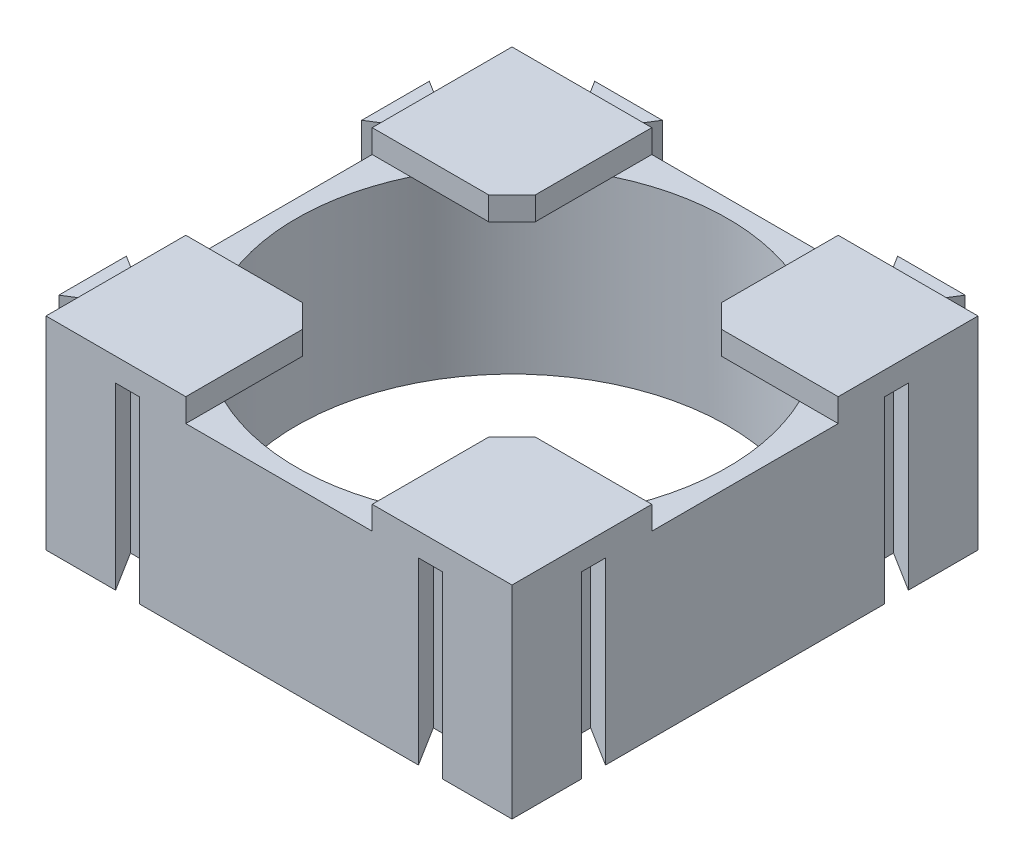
ISO-10303-21;
HEADER;
FILE_DESCRIPTION(('STEP AP214'),'2;1');
FILE_NAME('part.step','',(''),(''),'','','');
FILE_SCHEMA(('AUTOMOTIVE_DESIGN { 1 0 10303 214 1 1 1 1 }'));
ENDSEC;
DATA;
#1=APPLICATION_CONTEXT('core data for automotive mechanical design processes');
#2=APPLICATION_PROTOCOL_DEFINITION('international standard','automotive_design',2000,#1);
#3=PRODUCT_CONTEXT('',#1,'mechanical');
#4=PRODUCT('Part','Part','',(#3));
#5=PRODUCT_RELATED_PRODUCT_CATEGORY('part','',(#4));
#6=PRODUCT_DEFINITION_FORMATION('','',#4);
#7=PRODUCT_DEFINITION_CONTEXT('part definition',#1,'design');
#8=PRODUCT_DEFINITION('design','',#6,#7);
#9=PRODUCT_DEFINITION_SHAPE('','',#8);
#10=(LENGTH_UNIT() NAMED_UNIT(*) SI_UNIT(.MILLI.,.METRE.));
#11=(NAMED_UNIT(*) PLANE_ANGLE_UNIT() SI_UNIT($,.RADIAN.));
#12=(NAMED_UNIT(*) SI_UNIT($,.STERADIAN.) SOLID_ANGLE_UNIT());
#13=UNCERTAINTY_MEASURE_WITH_UNIT(LENGTH_MEASURE(1.E-05),#10,'distance_accuracy_value','');
#14=(GEOMETRIC_REPRESENTATION_CONTEXT(3) GLOBAL_UNCERTAINTY_ASSIGNED_CONTEXT((#13)) GLOBAL_UNIT_ASSIGNED_CONTEXT((#10,
#11,#12)) REPRESENTATION_CONTEXT('',''));
#15=CARTESIAN_POINT('',(0.,0.,0.));
#16=DIRECTION('',(0.,0.,1.));
#17=DIRECTION('',(1.,0.,0.));
#18=AXIS2_PLACEMENT_3D('',#15,#16,#17);
#19=CARTESIAN_POINT('',(0.,7.7,0.));
#20=DIRECTION('',(0.,1.,0.));
#21=DIRECTION('',(0.,0.,1.));
#22=AXIS2_PLACEMENT_3D('',#19,#20,#21);
#23=PLANE('',#22);
#24=CARTESIAN_POINT('',(0.,7.7,0.));
#25=DIRECTION('',(0.,1.,0.));
#26=DIRECTION('',(0.,0.,1.));
#27=AXIS2_PLACEMENT_3D('',#24,#25,#26);
#28=CIRCLE('',#27,9.25);
#29=CARTESIAN_POINT('',(8.3404136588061,7.7,4.00000000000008));
#30=VERTEX_POINT('',#29);
#31=CARTESIAN_POINT('',(8.34041365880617,7.7,-3.99999999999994));
#32=VERTEX_POINT('',#31);
#33=EDGE_CURVE('E528',#30,#32,#28,.T.);
#34=ORIENTED_EDGE('',*,*,#33,.F.);
#35=DIRECTION('',(-1.,0.,0.));
#36=VECTOR('',#35,1.);
#37=CARTESIAN_POINT('',(9.99999999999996,7.7,4.0000000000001));
#38=LINE('',#37,#36);
#39=CARTESIAN_POINT('',(9.99999999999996,7.7,4.0000000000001));
#40=VERTEX_POINT('',#39);
#41=EDGE_CURVE('E49',#40,#30,#38,.T.);
#42=ORIENTED_EDGE('',*,*,#41,.F.);
#43=DIRECTION('',(0.,0.,-1.));
#44=VECTOR('',#43,1.);
#45=CARTESIAN_POINT('',(10.0000000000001,7.7,-5.9873040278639));
#46=LINE('',#45,#44);
#47=CARTESIAN_POINT('',(10.,7.7,-3.99999999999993));
#48=VERTEX_POINT('',#47);
#49=EDGE_CURVE('E409',#40,#48,#46,.T.);
#50=ORIENTED_EDGE('',*,*,#49,.T.);
#51=DIRECTION('',(1.,0.,0.));
#52=VECTOR('',#51,1.);
#53=CARTESIAN_POINT('',(10.,7.7,-3.99999999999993));
#54=LINE('',#53,#52);
#55=EDGE_CURVE('E435',#32,#48,#54,.T.);
#56=ORIENTED_EDGE('',*,*,#55,.F.);
#57=EDGE_LOOP('',(#34,#42,#50,#56));
#58=FACE_BOUND('',#57,.T.);
#59=ADVANCED_FACE('F34',(#58),#23,.T.);
#60=DIRECTION('',(1.,0.,0.));
#61=VECTOR('',#60,1.);
#62=CARTESIAN_POINT('',(-5.987304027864,7.7,10.));
#63=LINE('',#62,#61);
#64=CARTESIAN_POINT('',(-3.99999999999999,7.7,10.));
#65=VERTEX_POINT('',#64);
#66=CARTESIAN_POINT('',(3.99999999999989,7.7,10.));
#67=VERTEX_POINT('',#66);
#68=EDGE_CURVE('E584',#65,#67,#63,.T.);
#69=ORIENTED_EDGE('',*,*,#68,.T.);
#70=DIRECTION('',(0.,0.,1.));
#71=VECTOR('',#70,1.);
#72=CARTESIAN_POINT('',(3.99999999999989,7.7,10.));
#73=LINE('',#72,#71);
#74=CARTESIAN_POINT('',(3.99999999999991,7.7,8.34041365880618));
#75=VERTEX_POINT('',#74);
#76=EDGE_CURVE('E797',#75,#67,#73,.T.);
#77=ORIENTED_EDGE('',*,*,#76,.F.);
#78=CARTESIAN_POINT('',(-3.99999999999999,7.7,8.34041365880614));
#79=VERTEX_POINT('',#78);
#80=EDGE_CURVE('E527',#79,#75,#28,.T.);
#81=ORIENTED_EDGE('',*,*,#80,.F.);
#82=DIRECTION('',(0.,0.,-1.));
#83=VECTOR('',#82,1.);
#84=CARTESIAN_POINT('',(-3.99999999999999,7.7,10.));
#85=LINE('',#84,#83);
#86=EDGE_CURVE('E505',#65,#79,#85,.T.);
#87=ORIENTED_EDGE('',*,*,#86,.F.);
#88=EDGE_LOOP('',(#69,#77,#81,#87));
#89=FACE_BOUND('',#88,.T.);
#90=ADVANCED_FACE('F869',(#89),#23,.T.);
#91=DIRECTION('',(0.529919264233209,0.,0.848048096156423));
#92=VECTOR('',#91,1.);
#93=CARTESIAN_POINT('',(5.987304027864,7.7,-10.));
#94=LINE('',#93,#92);
#95=CARTESIAN_POINT('',(5.05,7.7,-11.5));
#96=VERTEX_POINT('',#95);
#97=CARTESIAN_POINT('',(5.987304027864,7.7,-9.99999999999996));
#98=VERTEX_POINT('',#97);
#99=EDGE_CURVE('E550',#96,#98,#94,.T.);
#100=ORIENTED_EDGE('',*,*,#99,.T.);
#101=DIRECTION('',(-1.,0.,0.));
#102=VECTOR('',#101,1.);
#103=CARTESIAN_POINT('',(10.0000000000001,7.7,-9.99999999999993));
#104=LINE('',#103,#102);
#105=CARTESIAN_POINT('',(7.012695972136,7.7,-9.99999999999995));
#106=VERTEX_POINT('',#105);
#107=EDGE_CURVE('E410',#106,#98,#104,.T.);
#108=ORIENTED_EDGE('',*,*,#107,.F.);
#109=DIRECTION('',(0.529919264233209,0.,-0.848048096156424));
#110=VECTOR('',#109,1.);
#111=CARTESIAN_POINT('',(7.012695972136,7.7,-10.));
#112=LINE('',#111,#110);
#113=CARTESIAN_POINT('',(7.95,7.7,-11.5));
#114=VERTEX_POINT('',#113);
#115=EDGE_CURVE('E546',#106,#114,#112,.T.);
#116=ORIENTED_EDGE('',*,*,#115,.T.);
#117=DIRECTION('',(-1.,0.,0.));
#118=VECTOR('',#117,1.);
#119=CARTESIAN_POINT('',(7.95,7.7,-11.5));
#120=LINE('',#119,#118);
#121=EDGE_CURVE('E548',#114,#96,#120,.T.);
#122=ORIENTED_EDGE('',*,*,#121,.T.);
#123=EDGE_LOOP('',(#100,#108,#116,#122));
#124=FACE_BOUND('',#123,.T.);
#125=ADVANCED_FACE('F890',(#124),#23,.T.);
#126=CARTESIAN_POINT('',(4.00000000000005,7.7,-8.34041365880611));
#127=VERTEX_POINT('',#126);
#128=CARTESIAN_POINT('',(-3.99999999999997,7.7,-8.34041365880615));
#129=VERTEX_POINT('',#128);
#130=EDGE_CURVE('E823',#127,#129,#28,.T.);
#131=ORIENTED_EDGE('',*,*,#130,.F.);
#132=DIRECTION('',(0.,0.,1.));
#133=VECTOR('',#132,1.);
#134=CARTESIAN_POINT('',(4.00000000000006,7.7,-9.99999999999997));
#135=LINE('',#134,#133);
#136=CARTESIAN_POINT('',(4.00000000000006,7.7,-9.99999999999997));
#137=VERTEX_POINT('',#136);
#138=EDGE_CURVE('E57',#137,#127,#135,.T.);
#139=ORIENTED_EDGE('',*,*,#138,.F.);
#140=DIRECTION('',(-1.,0.,0.));
#141=VECTOR('',#140,1.);
#142=CARTESIAN_POINT('',(-5.987304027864,7.7,-10.));
#143=LINE('',#142,#141);
#144=CARTESIAN_POINT('',(-3.99999999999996,7.7,-10.));
#145=VERTEX_POINT('',#144);
#146=EDGE_CURVE('E553',#137,#145,#143,.T.);
#147=ORIENTED_EDGE('',*,*,#146,.T.);
#148=DIRECTION('',(0.,0.,-1.));
#149=VECTOR('',#148,1.);
#150=CARTESIAN_POINT('',(-3.99999999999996,7.7,-10.));
#151=LINE('',#150,#149);
#152=EDGE_CURVE('E471',#129,#145,#151,.T.);
#153=ORIENTED_EDGE('',*,*,#152,.F.);
#154=EDGE_LOOP('',(#131,#139,#147,#153));
#155=FACE_BOUND('',#154,.T.);
#156=ADVANCED_FACE('F1418',(#155),#23,.T.);
#157=DIRECTION('',(0.848048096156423,0.,-0.529919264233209));
#158=VECTOR('',#157,1.);
#159=CARTESIAN_POINT('',(-10.,7.7,-5.98730402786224));
#160=LINE('',#159,#158);
#161=CARTESIAN_POINT('',(-11.5,7.7,-5.04999999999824));
#162=VERTEX_POINT('',#161);
#163=CARTESIAN_POINT('',(-9.99999999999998,7.7,-5.98730402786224));
#164=VERTEX_POINT('',#163);
#165=EDGE_CURVE('E566',#162,#164,#160,.T.);
#166=ORIENTED_EDGE('',*,*,#165,.T.);
#167=DIRECTION('',(0.,0.,1.));
#168=VECTOR('',#167,1.);
#169=CARTESIAN_POINT('',(-9.99999999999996,7.7,-10.));
#170=LINE('',#169,#168);
#171=CARTESIAN_POINT('',(-9.99999999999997,7.7,-7.01269597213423));
#172=VERTEX_POINT('',#171);
#173=EDGE_CURVE('E450',#172,#164,#170,.T.);
#174=ORIENTED_EDGE('',*,*,#173,.F.);
#175=DIRECTION('',(-0.848048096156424,0.,-0.529919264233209));
#176=VECTOR('',#175,1.);
#177=CARTESIAN_POINT('',(-10.,7.7,-7.01269597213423));
#178=LINE('',#177,#176);
#179=CARTESIAN_POINT('',(-11.5,7.7,-7.94999999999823));
#180=VERTEX_POINT('',#179);
#181=EDGE_CURVE('E562',#172,#180,#178,.T.);
#182=ORIENTED_EDGE('',*,*,#181,.T.);
#183=DIRECTION('',(0.,0.,1.));
#184=VECTOR('',#183,1.);
#185=CARTESIAN_POINT('',(-11.5,7.7,-7.94999999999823));
#186=LINE('',#185,#184);
#187=EDGE_CURVE('E564',#180,#162,#186,.T.);
#188=ORIENTED_EDGE('',*,*,#187,.T.);
#189=EDGE_LOOP('',(#166,#174,#182,#188));
#190=FACE_BOUND('',#189,.T.);
#191=ADVANCED_FACE('F1410',(#190),#23,.T.);
#192=CARTESIAN_POINT('',(-8.34041365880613,7.7,-4.00000000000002));
#193=VERTEX_POINT('',#192);
#194=CARTESIAN_POINT('',(-8.34041365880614,7.7,4.));
#195=VERTEX_POINT('',#194);
#196=EDGE_CURVE('E531',#193,#195,#28,.T.);
#197=ORIENTED_EDGE('',*,*,#196,.F.);
#198=DIRECTION('',(1.,0.,0.));
#199=VECTOR('',#198,1.);
#200=CARTESIAN_POINT('',(-9.99999999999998,7.7,-4.00000000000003));
#201=LINE('',#200,#199);
#202=CARTESIAN_POINT('',(-9.99999999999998,7.7,-4.00000000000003));
#203=VERTEX_POINT('',#202);
#204=EDGE_CURVE('E467',#203,#193,#201,.T.);
#205=ORIENTED_EDGE('',*,*,#204,.F.);
#206=DIRECTION('',(0.,0.,1.));
#207=VECTOR('',#206,1.);
#208=CARTESIAN_POINT('',(-10.,7.7,-5.98730402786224));
#209=LINE('',#208,#207);
#210=CARTESIAN_POINT('',(-9.99999999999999,7.7,4.));
#211=VERTEX_POINT('',#210);
#212=EDGE_CURVE('E569',#203,#211,#209,.T.);
#213=ORIENTED_EDGE('',*,*,#212,.T.);
#214=DIRECTION('',(-1.,0.,0.));
#215=VECTOR('',#214,1.);
#216=CARTESIAN_POINT('',(-9.99999999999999,7.7,4.));
#217=LINE('',#216,#215);
#218=EDGE_CURVE('E509',#195,#211,#217,.T.);
#219=ORIENTED_EDGE('',*,*,#218,.F.);
#220=EDGE_LOOP('',(#197,#205,#213,#219));
#221=FACE_BOUND('',#220,.T.);
#222=ADVANCED_FACE('F849',(#221),#23,.T.);
#223=DIRECTION('',(0.529919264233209,0.,0.848048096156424));
#224=VECTOR('',#223,1.);
#225=CARTESIAN_POINT('',(-7.012695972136,7.7,-10.));
#226=LINE('',#225,#224);
#227=CARTESIAN_POINT('',(-7.95,7.7,-11.5));
#228=VERTEX_POINT('',#227);
#229=CARTESIAN_POINT('',(-7.012695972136,7.7,-10.));
#230=VERTEX_POINT('',#229);
#231=EDGE_CURVE('E559',#228,#230,#226,.T.);
#232=ORIENTED_EDGE('',*,*,#231,.T.);
#233=DIRECTION('',(-1.,0.,0.));
#234=VECTOR('',#233,1.);
#235=CARTESIAN_POINT('',(-9.99999999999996,7.7,-10.));
#236=LINE('',#235,#234);
#237=CARTESIAN_POINT('',(-5.987304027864,7.7,-10.));
#238=VERTEX_POINT('',#237);
#239=EDGE_CURVE('E455',#238,#230,#236,.T.);
#240=ORIENTED_EDGE('',*,*,#239,.F.);
#241=DIRECTION('',(0.529919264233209,0.,-0.848048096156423));
#242=VECTOR('',#241,1.);
#243=CARTESIAN_POINT('',(-5.987304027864,7.7,-10.));
#244=LINE('',#243,#242);
#245=CARTESIAN_POINT('',(-5.05,7.7,-11.5));
#246=VERTEX_POINT('',#245);
#247=EDGE_CURVE('E555',#238,#246,#244,.T.);
#248=ORIENTED_EDGE('',*,*,#247,.T.);
#249=DIRECTION('',(-1.,0.,0.));
#250=VECTOR('',#249,1.);
#251=CARTESIAN_POINT('',(-7.95,7.7,-11.5));
#252=LINE('',#251,#250);
#253=EDGE_CURVE('E557',#246,#228,#252,.T.);
#254=ORIENTED_EDGE('',*,*,#253,.T.);
#255=EDGE_LOOP('',(#232,#240,#248,#254));
#256=FACE_BOUND('',#255,.T.);
#257=ADVANCED_FACE('F894',(#256),#23,.T.);
#258=DIRECTION('',(0.848048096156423,0.,-0.529919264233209));
#259=VECTOR('',#258,1.);
#260=CARTESIAN_POINT('',(-10.,7.7,7.01269597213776));
#261=LINE('',#260,#259);
#262=CARTESIAN_POINT('',(-11.5,7.7,7.95000000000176));
#263=VERTEX_POINT('',#262);
#264=CARTESIAN_POINT('',(-9.99999999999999,7.7,7.01269597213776));
#265=VERTEX_POINT('',#264);
#266=EDGE_CURVE('E575',#263,#265,#261,.T.);
#267=ORIENTED_EDGE('',*,*,#266,.T.);
#268=DIRECTION('',(0.,0.,1.));
#269=VECTOR('',#268,1.);
#270=CARTESIAN_POINT('',(-9.99999999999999,7.7,10.));
#271=LINE('',#270,#269);
#272=CARTESIAN_POINT('',(-9.99999999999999,7.7,5.98730402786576));
#273=VERTEX_POINT('',#272);
#274=EDGE_CURVE('E486',#273,#265,#271,.T.);
#275=ORIENTED_EDGE('',*,*,#274,.F.);
#276=DIRECTION('',(-0.848048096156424,0.,-0.529919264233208));
#277=VECTOR('',#276,1.);
#278=CARTESIAN_POINT('',(-10.,7.7,5.98730402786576));
#279=LINE('',#278,#277);
#280=CARTESIAN_POINT('',(-11.5,7.7,5.05000000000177));
#281=VERTEX_POINT('',#280);
#282=EDGE_CURVE('E571',#273,#281,#279,.T.);
#283=ORIENTED_EDGE('',*,*,#282,.T.);
#284=DIRECTION('',(0.,0.,1.));
#285=VECTOR('',#284,1.);
#286=CARTESIAN_POINT('',(-11.5,7.7,7.95000000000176));
#287=LINE('',#286,#285);
#288=EDGE_CURVE('E573',#281,#263,#287,.T.);
#289=ORIENTED_EDGE('',*,*,#288,.T.);
#290=EDGE_LOOP('',(#267,#275,#283,#289));
#291=FACE_BOUND('',#290,.T.);
#292=ADVANCED_FACE('F886',(#291),#23,.T.);
#293=CARTESIAN_POINT('',(0.,0.,0.));
#294=DIRECTION('',(0.,1.,0.));
#295=DIRECTION('',(0.,0.,1.));
#296=AXIS2_PLACEMENT_3D('',#293,#294,#295);
#297=PLANE('',#296);
#298=DIRECTION('',(0.,0.,-1.));
#299=VECTOR('',#298,1.);
#300=CARTESIAN_POINT('',(9.99999999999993,0.,7.0126959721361));
#301=LINE('',#300,#299);
#302=CARTESIAN_POINT('',(10.,0.,10.));
#303=VERTEX_POINT('',#302);
#304=CARTESIAN_POINT('',(9.99999999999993,0.,7.0126959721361));
#305=VERTEX_POINT('',#304);
#306=EDGE_CURVE('E526',#303,#305,#301,.T.);
#307=ORIENTED_EDGE('',*,*,#306,.F.);
#308=DIRECTION('',(1.,0.,0.));
#309=VECTOR('',#308,1.);
#310=CARTESIAN_POINT('',(7.012695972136,0.,10.));
#311=LINE('',#310,#309);
#312=CARTESIAN_POINT('',(7.012695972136,0.,10.));
#313=VERTEX_POINT('',#312);
#314=EDGE_CURVE('E535',#313,#303,#311,.T.);
#315=ORIENTED_EDGE('',*,*,#314,.F.);
#316=DIRECTION('',(-0.529919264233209,0.,0.848048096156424));
#317=VECTOR('',#316,1.);
#318=CARTESIAN_POINT('',(7.012695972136,0.,10.));
#319=LINE('',#318,#317);
#320=CARTESIAN_POINT('',(8.07497387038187,0.,8.3));
#321=VERTEX_POINT('',#320);
#322=EDGE_CURVE('E662',#321,#313,#319,.T.);
#323=ORIENTED_EDGE('',*,*,#322,.F.);
#324=DIRECTION('',(1.,0.,0.));
#325=VECTOR('',#324,1.);
#326=CARTESIAN_POINT('',(8.07497387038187,0.,8.3));
#327=LINE('',#326,#325);
#328=CARTESIAN_POINT('',(4.92502612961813,0.,8.3));
#329=VERTEX_POINT('',#328);
#330=EDGE_CURVE('E660',#329,#321,#327,.T.);
#331=ORIENTED_EDGE('',*,*,#330,.F.);
#332=DIRECTION('',(-0.52991926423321,0.,-0.848048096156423));
#333=VECTOR('',#332,1.);
#334=CARTESIAN_POINT('',(5.987304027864,0.,10.));
#335=LINE('',#334,#333);
#336=CARTESIAN_POINT('',(5.987304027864,0.,10.));
#337=VERTEX_POINT('',#336);
#338=EDGE_CURVE('E658',#337,#329,#335,.T.);
#339=ORIENTED_EDGE('',*,*,#338,.F.);
#340=DIRECTION('',(1.,0.,0.));
#341=VECTOR('',#340,1.);
#342=CARTESIAN_POINT('',(-5.987304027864,0.,10.));
#343=LINE('',#342,#341);
#344=CARTESIAN_POINT('',(-5.987304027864,0.,10.));
#345=VERTEX_POINT('',#344);
#346=EDGE_CURVE('E656',#345,#337,#343,.T.);
#347=ORIENTED_EDGE('',*,*,#346,.F.);
#348=DIRECTION('',(-0.52991926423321,0.,0.848048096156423));
#349=VECTOR('',#348,1.);
#350=CARTESIAN_POINT('',(-5.987304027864,0.,10.));
#351=LINE('',#350,#349);
#352=CARTESIAN_POINT('',(-4.92502612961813,0.,8.3));
#353=VERTEX_POINT('',#352);
#354=EDGE_CURVE('E654',#353,#345,#351,.T.);
#355=ORIENTED_EDGE('',*,*,#354,.F.);
#356=DIRECTION('',(1.,0.,0.));
#357=VECTOR('',#356,1.);
#358=CARTESIAN_POINT('',(-8.07497387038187,0.,8.3));
#359=LINE('',#358,#357);
#360=CARTESIAN_POINT('',(-8.07497387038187,0.,8.3));
#361=VERTEX_POINT('',#360);
#362=EDGE_CURVE('E652',#361,#353,#359,.T.);
#363=ORIENTED_EDGE('',*,*,#362,.F.);
#364=DIRECTION('',(-0.529919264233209,0.,-0.848048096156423));
#365=VECTOR('',#364,1.);
#366=CARTESIAN_POINT('',(-7.012695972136,0.,10.));
#367=LINE('',#366,#365);
#368=CARTESIAN_POINT('',(-7.012695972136,0.,10.));
#369=VERTEX_POINT('',#368);
#370=EDGE_CURVE('E650',#369,#361,#367,.T.);
#371=ORIENTED_EDGE('',*,*,#370,.F.);
#372=DIRECTION('',(1.,0.,0.));
#373=VECTOR('',#372,1.);
#374=CARTESIAN_POINT('',(-9.99999999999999,0.,10.));
#375=LINE('',#374,#373);
#376=CARTESIAN_POINT('',(-9.99999999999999,0.,10.));
#377=VERTEX_POINT('',#376);
#378=EDGE_CURVE('E648',#377,#369,#375,.T.);
#379=ORIENTED_EDGE('',*,*,#378,.F.);
#380=DIRECTION('',(0.,0.,1.));
#381=VECTOR('',#380,1.);
#382=CARTESIAN_POINT('',(-10.,0.,7.01269597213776));
#383=LINE('',#382,#381);
#384=CARTESIAN_POINT('',(-10.,0.,7.01269597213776));
#385=VERTEX_POINT('',#384);
#386=EDGE_CURVE('E646',#385,#377,#383,.T.);
#387=ORIENTED_EDGE('',*,*,#386,.F.);
#388=DIRECTION('',(0.848048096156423,0.,-0.529919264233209));
#389=VECTOR('',#388,1.);
#390=CARTESIAN_POINT('',(-10.,0.,7.01269597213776));
#391=LINE('',#390,#389);
#392=CARTESIAN_POINT('',(-11.5,0.,7.95000000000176));
#393=VERTEX_POINT('',#392);
#394=EDGE_CURVE('E644',#393,#385,#391,.T.);
#395=ORIENTED_EDGE('',*,*,#394,.F.);
#396=DIRECTION('',(0.,0.,1.));
#397=VECTOR('',#396,1.);
#398=CARTESIAN_POINT('',(-11.5,0.,7.95000000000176));
#399=LINE('',#398,#397);
#400=CARTESIAN_POINT('',(-11.5,0.,5.05000000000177));
#401=VERTEX_POINT('',#400);
#402=EDGE_CURVE('E642',#401,#393,#399,.T.);
#403=ORIENTED_EDGE('',*,*,#402,.F.);
#404=DIRECTION('',(-0.848048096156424,0.,-0.529919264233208));
#405=VECTOR('',#404,1.);
#406=CARTESIAN_POINT('',(-10.,0.,5.98730402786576));
#407=LINE('',#406,#405);
#408=CARTESIAN_POINT('',(-10.,0.,5.98730402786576));
#409=VERTEX_POINT('',#408);
#410=EDGE_CURVE('E640',#409,#401,#407,.T.);
#411=ORIENTED_EDGE('',*,*,#410,.F.);
#412=DIRECTION('',(0.,0.,1.));
#413=VECTOR('',#412,1.);
#414=CARTESIAN_POINT('',(-10.,0.,-5.98730402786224));
#415=LINE('',#414,#413);
#416=CARTESIAN_POINT('',(-10.,0.,-5.98730402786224));
#417=VERTEX_POINT('',#416);
#418=EDGE_CURVE('E638',#417,#409,#415,.T.);
#419=ORIENTED_EDGE('',*,*,#418,.F.);
#420=DIRECTION('',(0.848048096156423,0.,-0.529919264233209));
#421=VECTOR('',#420,1.);
#422=CARTESIAN_POINT('',(-10.,0.,-5.98730402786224));
#423=LINE('',#422,#421);
#424=CARTESIAN_POINT('',(-11.5,0.,-5.04999999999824));
#425=VERTEX_POINT('',#424);
#426=EDGE_CURVE('E636',#425,#417,#423,.T.);
#427=ORIENTED_EDGE('',*,*,#426,.F.);
#428=DIRECTION('',(0.,0.,1.));
#429=VECTOR('',#428,1.);
#430=CARTESIAN_POINT('',(-11.5,0.,-7.94999999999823));
#431=LINE('',#430,#429);
#432=CARTESIAN_POINT('',(-11.5,0.,-7.94999999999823));
#433=VERTEX_POINT('',#432);
#434=EDGE_CURVE('E634',#433,#425,#431,.T.);
#435=ORIENTED_EDGE('',*,*,#434,.F.);
#436=DIRECTION('',(-0.848048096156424,0.,-0.529919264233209));
#437=VECTOR('',#436,1.);
#438=CARTESIAN_POINT('',(-10.,0.,-7.01269597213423));
#439=LINE('',#438,#437);
#440=CARTESIAN_POINT('',(-10.,0.,-7.01269597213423));
#441=VERTEX_POINT('',#440);
#442=EDGE_CURVE('E632',#441,#433,#439,.T.);
#443=ORIENTED_EDGE('',*,*,#442,.F.);
#444=DIRECTION('',(0.,0.,1.));
#445=VECTOR('',#444,1.);
#446=CARTESIAN_POINT('',(-10.,0.,-10.));
#447=LINE('',#446,#445);
#448=CARTESIAN_POINT('',(-10.,0.,-10.));
#449=VERTEX_POINT('',#448);
#450=EDGE_CURVE('E630',#449,#441,#447,.T.);
#451=ORIENTED_EDGE('',*,*,#450,.F.);
#452=DIRECTION('',(-1.,0.,0.));
#453=VECTOR('',#452,1.);
#454=CARTESIAN_POINT('',(-10.,0.,-10.));
#455=LINE('',#454,#453);
#456=CARTESIAN_POINT('',(-7.012695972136,0.,-10.));
#457=VERTEX_POINT('',#456);
#458=EDGE_CURVE('E628',#457,#449,#455,.T.);
#459=ORIENTED_EDGE('',*,*,#458,.F.);
#460=DIRECTION('',(0.529919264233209,0.,0.848048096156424));
#461=VECTOR('',#460,1.);
#462=CARTESIAN_POINT('',(-7.012695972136,0.,-10.));
#463=LINE('',#462,#461);
#464=CARTESIAN_POINT('',(-7.95,0.,-11.5));
#465=VERTEX_POINT('',#464);
#466=EDGE_CURVE('E626',#465,#457,#463,.T.);
#467=ORIENTED_EDGE('',*,*,#466,.F.);
#468=DIRECTION('',(-1.,0.,0.));
#469=VECTOR('',#468,1.);
#470=CARTESIAN_POINT('',(-7.95,0.,-11.5));
#471=LINE('',#470,#469);
#472=CARTESIAN_POINT('',(-5.05,0.,-11.5));
#473=VERTEX_POINT('',#472);
#474=EDGE_CURVE('E624',#473,#465,#471,.T.);
#475=ORIENTED_EDGE('',*,*,#474,.F.);
#476=DIRECTION('',(0.529919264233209,0.,-0.848048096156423));
#477=VECTOR('',#476,1.);
#478=CARTESIAN_POINT('',(-5.987304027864,0.,-10.));
#479=LINE('',#478,#477);
#480=CARTESIAN_POINT('',(-5.987304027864,0.,-10.));
#481=VERTEX_POINT('',#480);
#482=EDGE_CURVE('E622',#481,#473,#479,.T.);
#483=ORIENTED_EDGE('',*,*,#482,.F.);
#484=DIRECTION('',(-1.,0.,0.));
#485=VECTOR('',#484,1.);
#486=CARTESIAN_POINT('',(-5.987304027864,0.,-10.));
#487=LINE('',#486,#485);
#488=CARTESIAN_POINT('',(5.987304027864,0.,-10.));
#489=VERTEX_POINT('',#488);
#490=EDGE_CURVE('E620',#489,#481,#487,.T.);
#491=ORIENTED_EDGE('',*,*,#490,.F.);
#492=DIRECTION('',(0.529919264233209,0.,0.848048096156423));
#493=VECTOR('',#492,1.);
#494=CARTESIAN_POINT('',(5.987304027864,0.,-10.));
#495=LINE('',#494,#493);
#496=CARTESIAN_POINT('',(5.05,0.,-11.5));
#497=VERTEX_POINT('',#496);
#498=EDGE_CURVE('E618',#497,#489,#495,.T.);
#499=ORIENTED_EDGE('',*,*,#498,.F.);
#500=DIRECTION('',(-1.,0.,0.));
#501=VECTOR('',#500,1.);
#502=CARTESIAN_POINT('',(7.95,0.,-11.5));
#503=LINE('',#502,#501);
#504=CARTESIAN_POINT('',(7.95,0.,-11.5));
#505=VERTEX_POINT('',#504);
#506=EDGE_CURVE('E616',#505,#497,#503,.T.);
#507=ORIENTED_EDGE('',*,*,#506,.F.);
#508=DIRECTION('',(0.529919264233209,0.,-0.848048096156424));
#509=VECTOR('',#508,1.);
#510=CARTESIAN_POINT('',(7.012695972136,0.,-10.));
#511=LINE('',#510,#509);
#512=CARTESIAN_POINT('',(7.012695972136,0.,-10.));
#513=VERTEX_POINT('',#512);
#514=EDGE_CURVE('E614',#513,#505,#511,.T.);
#515=ORIENTED_EDGE('',*,*,#514,.F.);
#516=DIRECTION('',(-1.,0.,0.));
#517=VECTOR('',#516,1.);
#518=CARTESIAN_POINT('',(7.012695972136,0.,-10.));
#519=LINE('',#518,#517);
#520=CARTESIAN_POINT('',(10.,0.,-10.));
#521=VERTEX_POINT('',#520);
#522=EDGE_CURVE('E612',#521,#513,#519,.T.);
#523=ORIENTED_EDGE('',*,*,#522,.F.);
#524=DIRECTION('',(0.,0.,-1.));
#525=VECTOR('',#524,1.);
#526=CARTESIAN_POINT('',(10.,0.,-10.));
#527=LINE('',#526,#525);
#528=CARTESIAN_POINT('',(10.0000000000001,0.,-7.01269597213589));
#529=VERTEX_POINT('',#528);
#530=EDGE_CURVE('E610',#529,#521,#527,.T.);
#531=ORIENTED_EDGE('',*,*,#530,.F.);
#532=DIRECTION('',(0.848048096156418,0.,0.529919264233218));
#533=VECTOR('',#532,1.);
#534=CARTESIAN_POINT('',(10.0000000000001,0.,-7.01269597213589));
#535=LINE('',#534,#533);
#536=CARTESIAN_POINT('',(8.30000000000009,0.,-8.07497387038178));
#537=VERTEX_POINT('',#536);
#538=EDGE_CURVE('E608',#537,#529,#535,.T.);
#539=ORIENTED_EDGE('',*,*,#538,.F.);
#540=DIRECTION('',(0.,0.,-1.));
#541=VECTOR('',#540,1.);
#542=CARTESIAN_POINT('',(8.30000000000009,0.,-8.07497387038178));
#543=LINE('',#542,#541);
#544=CARTESIAN_POINT('',(8.30000000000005,0.,-4.92502612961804));
#545=VERTEX_POINT('',#544);
#546=EDGE_CURVE('E606',#545,#537,#543,.T.);
#547=ORIENTED_EDGE('',*,*,#546,.F.);
#548=DIRECTION('',(-0.848048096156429,0.,0.529919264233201));
#549=VECTOR('',#548,1.);
#550=CARTESIAN_POINT('',(10.0000000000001,0.,-5.9873040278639));
#551=LINE('',#550,#549);
#552=CARTESIAN_POINT('',(10.0000000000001,0.,-5.9873040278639));
#553=VERTEX_POINT('',#552);
#554=EDGE_CURVE('E604',#553,#545,#551,.T.);
#555=ORIENTED_EDGE('',*,*,#554,.F.);
#556=DIRECTION('',(0.,0.,-1.));
#557=VECTOR('',#556,1.);
#558=CARTESIAN_POINT('',(10.0000000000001,0.,-5.9873040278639));
#559=LINE('',#558,#557);
#560=CARTESIAN_POINT('',(9.99999999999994,0.,5.9873040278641));
#561=VERTEX_POINT('',#560);
#562=EDGE_CURVE('E602',#561,#553,#559,.T.);
#563=ORIENTED_EDGE('',*,*,#562,.F.);
#564=DIRECTION('',(0.848048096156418,0.,0.529919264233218));
#565=VECTOR('',#564,1.);
#566=CARTESIAN_POINT('',(9.99999999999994,0.,5.9873040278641));
#567=LINE('',#566,#565);
#568=CARTESIAN_POINT('',(8.29999999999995,0.,4.92502612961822));
#569=VERTEX_POINT('',#568);
#570=EDGE_CURVE('E600',#569,#561,#567,.T.);
#571=ORIENTED_EDGE('',*,*,#570,.F.);
#572=DIRECTION('',(0.,0.,-1.));
#573=VECTOR('',#572,1.);
#574=CARTESIAN_POINT('',(8.29999999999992,0.,8.07497387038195));
#575=LINE('',#574,#573);
#576=CARTESIAN_POINT('',(8.29999999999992,0.,8.07497387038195));
#577=VERTEX_POINT('',#576);
#578=EDGE_CURVE('E598',#577,#569,#575,.T.);
#579=ORIENTED_EDGE('',*,*,#578,.F.);
#580=DIRECTION('',(-0.848048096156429,0.,0.5299192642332));
#581=VECTOR('',#580,1.);
#582=CARTESIAN_POINT('',(9.99999999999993,0.,7.0126959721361));
#583=LINE('',#582,#581);
#584=EDGE_CURVE('E596',#305,#577,#583,.T.);
#585=ORIENTED_EDGE('',*,*,#584,.F.);
#586=EDGE_LOOP('',(#307,#315,#323,#331,#339,#347,#355,#363,#371,#379,#387,#395,#403,#411,#419,
#427,#435,#443,#451,#459,#467,#475,#483,#491,#499,#507,#515,#523,#531,#539,#547,#555,#563,#571,
#579,#585));
#587=FACE_BOUND('',#586,.T.);
#588=CARTESIAN_POINT('',(0.,0.,0.));
#589=DIRECTION('',(0.,1.,0.));
#590=DIRECTION('',(0.,0.,1.));
#591=AXIS2_PLACEMENT_3D('',#588,#589,#590);
#592=CIRCLE('',#591,9.25);
#593=CARTESIAN_POINT('',(0.,0.,9.25));
#594=VERTEX_POINT('',#593);
#595=EDGE_CURVE('E522',#594,#594,#592,.T.);
#596=ORIENTED_EDGE('',*,*,#595,.T.);
#597=EDGE_LOOP('',(#596));
#598=FACE_BOUND('',#597,.T.);
#599=ADVANCED_FACE('F776',(#587,#598),#297,.F.);
#600=CARTESIAN_POINT('',(9.99999999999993,7.7,7.0126959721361));
#601=DIRECTION('',(0.5299192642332,0.,0.848048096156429));
#602=DIRECTION('',(0.848048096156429,0.,-0.5299192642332));
#603=AXIS2_PLACEMENT_3D('',#600,#601,#602);
#604=PLANE('',#603);
#605=ORIENTED_EDGE('',*,*,#584,.T.);
#606=DIRECTION('',(0.,-1.,0.));
#607=VECTOR('',#606,1.);
#608=CARTESIAN_POINT('',(8.29999999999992,7.7,8.07497387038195));
#609=LINE('',#608,#607);
#610=CARTESIAN_POINT('',(8.29999999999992,7.7,8.07497387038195));
#611=VERTEX_POINT('',#610);
#612=EDGE_CURVE('E42',#611,#577,#609,.T.);
#613=ORIENTED_EDGE('',*,*,#612,.F.);
#614=DIRECTION('',(-0.848048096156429,0.,0.5299192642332));
#615=VECTOR('',#614,1.);
#616=CARTESIAN_POINT('',(9.99999999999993,7.7,7.0126959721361));
#617=LINE('',#616,#615);
#618=CARTESIAN_POINT('',(9.99999999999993,7.7,7.01269597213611));
#619=VERTEX_POINT('',#618);
#620=EDGE_CURVE('E532',#619,#611,#617,.T.);
#621=ORIENTED_EDGE('',*,*,#620,.F.);
#622=DIRECTION('',(0.,-1.,0.));
#623=VECTOR('',#622,1.);
#624=CARTESIAN_POINT('',(9.99999999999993,7.7,7.0126959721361));
#625=LINE('',#624,#623);
#626=EDGE_CURVE('E11',#619,#305,#625,.T.);
#627=ORIENTED_EDGE('',*,*,#626,.T.);
#628=EDGE_LOOP('',(#605,#613,#621,#627));
#629=FACE_BOUND('',#628,.T.);
#630=ADVANCED_FACE('F36',(#629),#604,.F.);
#631=CARTESIAN_POINT('',(8.29999999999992,7.7,8.07497387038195));
#632=DIRECTION('',(-1.,0.,0.));
#633=DIRECTION('',(0.,0.,1.));
#634=AXIS2_PLACEMENT_3D('',#631,#632,#633);
#635=PLANE('',#634);
#636=ORIENTED_EDGE('',*,*,#578,.T.);
#637=DIRECTION('',(0.,-1.,0.));
#638=VECTOR('',#637,1.);
#639=CARTESIAN_POINT('',(8.29999999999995,7.7,4.92502612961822));
#640=LINE('',#639,#638);
#641=CARTESIAN_POINT('',(8.29999999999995,7.7,4.92502612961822));
#642=VERTEX_POINT('',#641);
#643=EDGE_CURVE('E762',#642,#569,#640,.T.);
#644=ORIENTED_EDGE('',*,*,#643,.F.);
#645=DIRECTION('',(0.,0.,-1.));
#646=VECTOR('',#645,1.);
#647=CARTESIAN_POINT('',(8.29999999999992,7.7,8.07497387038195));
#648=LINE('',#647,#646);
#649=EDGE_CURVE('E534',#611,#642,#648,.T.);
#650=ORIENTED_EDGE('',*,*,#649,.F.);
#651=ORIENTED_EDGE('',*,*,#612,.T.);
#652=EDGE_LOOP('',(#636,#644,#650,#651));
#653=FACE_BOUND('',#652,.T.);
#654=ADVANCED_FACE('F769',(#653),#635,.F.);
#655=CARTESIAN_POINT('',(9.99999999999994,7.7,5.9873040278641));
#656=DIRECTION('',(0.529919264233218,0.,-0.848048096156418));
#657=DIRECTION('',(-0.848048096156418,0.,-0.529919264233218));
#658=AXIS2_PLACEMENT_3D('',#655,#656,#657);
#659=PLANE('',#658);
#660=ORIENTED_EDGE('',*,*,#570,.T.);
#661=DIRECTION('',(0.,-1.,0.));
#662=VECTOR('',#661,1.);
#663=CARTESIAN_POINT('',(9.99999999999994,7.7,5.9873040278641));
#664=LINE('',#663,#662);
#665=CARTESIAN_POINT('',(9.99999999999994,7.7,5.9873040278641));
#666=VERTEX_POINT('',#665);
#667=EDGE_CURVE('E759',#666,#561,#664,.T.);
#668=ORIENTED_EDGE('',*,*,#667,.F.);
#669=DIRECTION('',(0.848048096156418,0.,0.529919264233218));
#670=VECTOR('',#669,1.);
#671=CARTESIAN_POINT('',(9.99999999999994,7.7,5.9873040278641));
#672=LINE('',#671,#670);
#673=EDGE_CURVE('E537',#642,#666,#672,.T.);
#674=ORIENTED_EDGE('',*,*,#673,.F.);
#675=ORIENTED_EDGE('',*,*,#643,.T.);
#676=EDGE_LOOP('',(#660,#668,#674,#675));
#677=FACE_BOUND('',#676,.T.);
#678=ADVANCED_FACE('F782',(#677),#659,.F.);
#679=CARTESIAN_POINT('',(10.0000000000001,7.7,-5.9873040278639));
#680=DIRECTION('',(0.529919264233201,0.,0.848048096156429));
#681=DIRECTION('',(0.848048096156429,0.,-0.529919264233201));
#682=AXIS2_PLACEMENT_3D('',#679,#680,#681);
#683=PLANE('',#682);
#684=ORIENTED_EDGE('',*,*,#554,.T.);
#685=DIRECTION('',(0.,-1.,0.));
#686=VECTOR('',#685,1.);
#687=CARTESIAN_POINT('',(8.30000000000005,7.7,-4.92502612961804));
#688=LINE('',#687,#686);
#689=CARTESIAN_POINT('',(8.30000000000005,7.7,-4.92502612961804));
#690=VERTEX_POINT('',#689);
#691=EDGE_CURVE('E753',#690,#545,#688,.T.);
#692=ORIENTED_EDGE('',*,*,#691,.F.);
#693=DIRECTION('',(-0.848048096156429,0.,0.529919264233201));
#694=VECTOR('',#693,1.);
#695=CARTESIAN_POINT('',(10.0000000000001,7.7,-5.9873040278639));
#696=LINE('',#695,#694);
#697=CARTESIAN_POINT('',(10.,7.7,-5.98730402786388));
#698=VERTEX_POINT('',#697);
#699=EDGE_CURVE('E540',#698,#690,#696,.T.);
#700=ORIENTED_EDGE('',*,*,#699,.F.);
#701=DIRECTION('',(0.,-1.,0.));
#702=VECTOR('',#701,1.);
#703=CARTESIAN_POINT('',(10.0000000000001,7.7,-5.9873040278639));
#704=LINE('',#703,#702);
#705=EDGE_CURVE('E756',#698,#553,#704,.T.);
#706=ORIENTED_EDGE('',*,*,#705,.T.);
#707=EDGE_LOOP('',(#684,#692,#700,#706));
#708=FACE_BOUND('',#707,.T.);
#709=ADVANCED_FACE('F1027',(#708),#683,.F.);
#710=CARTESIAN_POINT('',(8.30000000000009,7.7,-8.07497387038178));
#711=DIRECTION('',(-1.,0.,0.));
#712=DIRECTION('',(0.,0.,1.));
#713=AXIS2_PLACEMENT_3D('',#710,#711,#712);
#714=PLANE('',#713);
#715=ORIENTED_EDGE('',*,*,#546,.T.);
#716=DIRECTION('',(0.,-1.,0.));
#717=VECTOR('',#716,1.);
#718=CARTESIAN_POINT('',(8.30000000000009,7.7,-8.07497387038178));
#719=LINE('',#718,#717);
#720=CARTESIAN_POINT('',(8.30000000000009,7.7,-8.07497387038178));
#721=VERTEX_POINT('',#720);
#722=EDGE_CURVE('E750',#721,#537,#719,.T.);
#723=ORIENTED_EDGE('',*,*,#722,.F.);
#724=DIRECTION('',(0.,0.,-1.));
#725=VECTOR('',#724,1.);
#726=CARTESIAN_POINT('',(8.30000000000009,7.7,-8.07497387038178));
#727=LINE('',#726,#725);
#728=EDGE_CURVE('E542',#690,#721,#727,.T.);
#729=ORIENTED_EDGE('',*,*,#728,.F.);
#730=ORIENTED_EDGE('',*,*,#691,.T.);
#731=EDGE_LOOP('',(#715,#723,#729,#730));
#732=FACE_BOUND('',#731,.T.);
#733=ADVANCED_FACE('F1023',(#732),#714,.F.);
#734=CARTESIAN_POINT('',(10.0000000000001,7.7,-7.01269597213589));
#735=DIRECTION('',(0.529919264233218,0.,-0.848048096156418));
#736=DIRECTION('',(-0.848048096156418,0.,-0.529919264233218));
#737=AXIS2_PLACEMENT_3D('',#734,#735,#736);
#738=PLANE('',#737);
#739=ORIENTED_EDGE('',*,*,#538,.T.);
#740=DIRECTION('',(0.,-1.,0.));
#741=VECTOR('',#740,1.);
#742=CARTESIAN_POINT('',(10.0000000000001,7.7,-7.01269597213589));
#743=LINE('',#742,#741);
#744=CARTESIAN_POINT('',(10.,7.7,-7.0126959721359));
#745=VERTEX_POINT('',#744);
#746=EDGE_CURVE('E747',#745,#529,#743,.T.);
#747=ORIENTED_EDGE('',*,*,#746,.F.);
#748=DIRECTION('',(0.848048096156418,0.,0.529919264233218));
#749=VECTOR('',#748,1.);
#750=CARTESIAN_POINT('',(10.0000000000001,7.7,-7.01269597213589));
#751=LINE('',#750,#749);
#752=EDGE_CURVE('E544',#721,#745,#751,.T.);
#753=ORIENTED_EDGE('',*,*,#752,.F.);
#754=ORIENTED_EDGE('',*,*,#722,.T.);
#755=EDGE_LOOP('',(#739,#747,#753,#754));
#756=FACE_BOUND('',#755,.T.);
#757=ADVANCED_FACE('F1020',(#756),#738,.F.);
#758=CARTESIAN_POINT('',(10.,7.7,-10.));
#759=DIRECTION('',(-1.,0.,0.));
#760=DIRECTION('',(0.,0.,1.));
#761=AXIS2_PLACEMENT_3D('',#758,#759,#760);
#762=PLANE('',#761);
#763=ORIENTED_EDGE('',*,*,#530,.T.);
#764=DIRECTION('',(0.,-1.,0.));
#765=VECTOR('',#764,1.);
#766=CARTESIAN_POINT('',(10.,7.7,-10.));
#767=LINE('',#766,#765);
#768=CARTESIAN_POINT('',(10.0000000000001,8.7,-9.99999999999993));
#769=VERTEX_POINT('',#768);
#770=EDGE_CURVE('E744',#769,#521,#767,.T.);
#771=ORIENTED_EDGE('',*,*,#770,.F.);
#772=DIRECTION('',(0.,0.,-1.));
#773=VECTOR('',#772,1.);
#774=CARTESIAN_POINT('',(10.0000000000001,8.7,-9.99999999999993));
#775=LINE('',#774,#773);
#776=CARTESIAN_POINT('',(10.,8.7,-3.99999999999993));
#777=VERTEX_POINT('',#776);
#778=EDGE_CURVE('E428',#777,#769,#775,.T.);
#779=ORIENTED_EDGE('',*,*,#778,.F.);
#780=DIRECTION('',(0.,-1.,0.));
#781=VECTOR('',#780,1.);
#782=CARTESIAN_POINT('',(10.,8.7,-3.99999999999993));
#783=LINE('',#782,#781);
#784=EDGE_CURVE('E430',#777,#48,#783,.T.);
#785=ORIENTED_EDGE('',*,*,#784,.T.);
#786=ORIENTED_EDGE('',*,*,#49,.F.);
#787=DIRECTION('',(0.,-1.,0.));
#788=VECTOR('',#787,1.);
#789=CARTESIAN_POINT('',(9.99999999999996,8.7,4.0000000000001));
#790=LINE('',#789,#788);
#791=CARTESIAN_POINT('',(9.99999999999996,8.7,4.0000000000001));
#792=VERTEX_POINT('',#791);
#793=EDGE_CURVE('E389',#792,#40,#790,.T.);
#794=ORIENTED_EDGE('',*,*,#793,.F.);
#795=DIRECTION('',(0.,0.,-1.));
#796=VECTOR('',#795,1.);
#797=CARTESIAN_POINT('',(9.9999999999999,8.7,10.0000000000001));
#798=LINE('',#797,#796);
#799=CARTESIAN_POINT('',(9.9999999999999,8.7,10.0000000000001));
#800=VERTEX_POINT('',#799);
#801=EDGE_CURVE('E395',#800,#792,#798,.T.);
#802=ORIENTED_EDGE('',*,*,#801,.F.);
#803=DIRECTION('',(0.,-1.,0.));
#804=VECTOR('',#803,1.);
#805=CARTESIAN_POINT('',(10.,7.7,10.));
#806=LINE('',#805,#804);
#807=EDGE_CURVE('E593',#800,#303,#806,.T.);
#808=ORIENTED_EDGE('',*,*,#807,.T.);
#809=ORIENTED_EDGE('',*,*,#306,.T.);
#810=ORIENTED_EDGE('',*,*,#626,.F.);
#811=DIRECTION('',(0.,0.,-1.));
#812=VECTOR('',#811,1.);
#813=CARTESIAN_POINT('',(9.9999999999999,7.7,10.0000000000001));
#814=LINE('',#813,#812);
#815=EDGE_CURVE('E787',#619,#666,#814,.T.);
#816=ORIENTED_EDGE('',*,*,#815,.T.);
#817=ORIENTED_EDGE('',*,*,#667,.T.);
#818=ORIENTED_EDGE('',*,*,#562,.T.);
#819=ORIENTED_EDGE('',*,*,#705,.F.);
#820=DIRECTION('',(0.,0.,-1.));
#821=VECTOR('',#820,1.);
#822=CARTESIAN_POINT('',(10.0000000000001,7.7,-9.99999999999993));
#823=LINE('',#822,#821);
#824=EDGE_CURVE('E422',#698,#745,#823,.T.);
#825=ORIENTED_EDGE('',*,*,#824,.T.);
#826=ORIENTED_EDGE('',*,*,#746,.T.);
#827=EDGE_LOOP('',(#763,#771,#779,#785,#786,#794,#802,#808,#809,#810,#816,#817,#818,#819,#825,#826));
#828=FACE_BOUND('',#827,.T.);
#829=ADVANCED_FACE('F407',(#828),#762,.F.);
#830=CARTESIAN_POINT('',(7.012695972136,7.7,-10.));
#831=DIRECTION('',(-0.848048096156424,0.,-0.529919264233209));
#832=DIRECTION('',(-0.529919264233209,0.,0.848048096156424));
#833=AXIS2_PLACEMENT_3D('',#830,#831,#832);
#834=PLANE('',#833);
#835=ORIENTED_EDGE('',*,*,#514,.T.);
#836=DIRECTION('',(0.,-1.,0.));
#837=VECTOR('',#836,1.);
#838=CARTESIAN_POINT('',(7.95,7.7,-11.5));
#839=LINE('',#838,#837);
#840=EDGE_CURVE('E738',#114,#505,#839,.T.);
#841=ORIENTED_EDGE('',*,*,#840,.F.);
#842=ORIENTED_EDGE('',*,*,#115,.F.);
#843=DIRECTION('',(0.,-1.,0.));
#844=VECTOR('',#843,1.);
#845=CARTESIAN_POINT('',(7.012695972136,7.7,-10.));
#846=LINE('',#845,#844);
#847=EDGE_CURVE('E741',#106,#513,#846,.T.);
#848=ORIENTED_EDGE('',*,*,#847,.T.);
#849=EDGE_LOOP('',(#835,#841,#842,#848));
#850=FACE_BOUND('',#849,.T.);
#851=ADVANCED_FACE('F1013',(#850),#834,.F.);
#852=CARTESIAN_POINT('',(7.95,7.7,-11.5));
#853=DIRECTION('',(0.,0.,1.));
#854=DIRECTION('',(1.,0.,0.));
#855=AXIS2_PLACEMENT_3D('',#852,#853,#854);
#856=PLANE('',#855);
#857=ORIENTED_EDGE('',*,*,#506,.T.);
#858=DIRECTION('',(0.,-1.,0.));
#859=VECTOR('',#858,1.);
#860=CARTESIAN_POINT('',(5.05,7.7,-11.5));
#861=LINE('',#860,#859);
#862=EDGE_CURVE('E735',#96,#497,#861,.T.);
#863=ORIENTED_EDGE('',*,*,#862,.F.);
#864=ORIENTED_EDGE('',*,*,#121,.F.);
#865=ORIENTED_EDGE('',*,*,#840,.T.);
#866=EDGE_LOOP('',(#857,#863,#864,#865));
#867=FACE_BOUND('',#866,.T.);
#868=ADVANCED_FACE('F1009',(#867),#856,.F.);
#869=CARTESIAN_POINT('',(5.987304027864,7.7,-10.));
#870=DIRECTION('',(0.848048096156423,0.,-0.529919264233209));
#871=DIRECTION('',(-0.52991926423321,0.,-0.848048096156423));
#872=AXIS2_PLACEMENT_3D('',#869,#870,#871);
#873=PLANE('',#872);
#874=ORIENTED_EDGE('',*,*,#498,.T.);
#875=DIRECTION('',(0.,-1.,0.));
#876=VECTOR('',#875,1.);
#877=CARTESIAN_POINT('',(5.987304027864,7.7,-10.));
#878=LINE('',#877,#876);
#879=EDGE_CURVE('E732',#98,#489,#878,.T.);
#880=ORIENTED_EDGE('',*,*,#879,.F.);
#881=ORIENTED_EDGE('',*,*,#99,.F.);
#882=ORIENTED_EDGE('',*,*,#862,.T.);
#883=EDGE_LOOP('',(#874,#880,#881,#882));
#884=FACE_BOUND('',#883,.T.);
#885=ADVANCED_FACE('F1005',(#884),#873,.F.);
#886=CARTESIAN_POINT('',(-5.987304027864,7.7,-10.));
#887=DIRECTION('',(-0.848048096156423,0.,-0.529919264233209));
#888=DIRECTION('',(-0.52991926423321,0.,0.848048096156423));
#889=AXIS2_PLACEMENT_3D('',#886,#887,#888);
#890=PLANE('',#889);
#891=ORIENTED_EDGE('',*,*,#482,.T.);
#892=DIRECTION('',(0.,-1.,0.));
#893=VECTOR('',#892,1.);
#894=CARTESIAN_POINT('',(-5.05,7.7,-11.5));
#895=LINE('',#894,#893);
#896=EDGE_CURVE('E726',#246,#473,#895,.T.);
#897=ORIENTED_EDGE('',*,*,#896,.F.);
#898=ORIENTED_EDGE('',*,*,#247,.F.);
#899=DIRECTION('',(0.,-1.,0.));
#900=VECTOR('',#899,1.);
#901=CARTESIAN_POINT('',(-5.987304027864,7.7,-10.));
#902=LINE('',#901,#900);
#903=EDGE_CURVE('E729',#238,#481,#902,.T.);
#904=ORIENTED_EDGE('',*,*,#903,.T.);
#905=EDGE_LOOP('',(#891,#897,#898,#904));
#906=FACE_BOUND('',#905,.T.);
#907=ADVANCED_FACE('F1001',(#906),#890,.F.);
#908=CARTESIAN_POINT('',(-7.95,7.7,-11.5));
#909=DIRECTION('',(0.,0.,1.));
#910=DIRECTION('',(1.,0.,0.));
#911=AXIS2_PLACEMENT_3D('',#908,#909,#910);
#912=PLANE('',#911);
#913=ORIENTED_EDGE('',*,*,#474,.T.);
#914=DIRECTION('',(0.,-1.,0.));
#915=VECTOR('',#914,1.);
#916=CARTESIAN_POINT('',(-7.95,7.7,-11.5));
#917=LINE('',#916,#915);
#918=EDGE_CURVE('E723',#228,#465,#917,.T.);
#919=ORIENTED_EDGE('',*,*,#918,.F.);
#920=ORIENTED_EDGE('',*,*,#253,.F.);
#921=ORIENTED_EDGE('',*,*,#896,.T.);
#922=EDGE_LOOP('',(#913,#919,#920,#921));
#923=FACE_BOUND('',#922,.T.);
#924=ADVANCED_FACE('F997',(#923),#912,.F.);
#925=CARTESIAN_POINT('',(-7.012695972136,7.7,-10.));
#926=DIRECTION('',(0.848048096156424,0.,-0.529919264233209));
#927=DIRECTION('',(-0.529919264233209,0.,-0.848048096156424));
#928=AXIS2_PLACEMENT_3D('',#925,#926,#927);
#929=PLANE('',#928);
#930=ORIENTED_EDGE('',*,*,#466,.T.);
#931=DIRECTION('',(0.,-1.,0.));
#932=VECTOR('',#931,1.);
#933=CARTESIAN_POINT('',(-7.012695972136,7.7,-10.));
#934=LINE('',#933,#932);
#935=EDGE_CURVE('E720',#230,#457,#934,.T.);
#936=ORIENTED_EDGE('',*,*,#935,.F.);
#937=ORIENTED_EDGE('',*,*,#231,.F.);
#938=ORIENTED_EDGE('',*,*,#918,.T.);
#939=EDGE_LOOP('',(#930,#936,#937,#938));
#940=FACE_BOUND('',#939,.T.);
#941=ADVANCED_FACE('F993',(#940),#929,.F.);
#942=CARTESIAN_POINT('',(-10.,7.7,-10.));
#943=DIRECTION('',(0.,0.,1.));
#944=DIRECTION('',(1.,0.,0.));
#945=AXIS2_PLACEMENT_3D('',#942,#943,#944);
#946=PLANE('',#945);
#947=ORIENTED_EDGE('',*,*,#458,.T.);
#948=DIRECTION('',(0.,-1.,0.));
#949=VECTOR('',#948,1.);
#950=CARTESIAN_POINT('',(-10.,7.7,-10.));
#951=LINE('',#950,#949);
#952=CARTESIAN_POINT('',(-9.99999999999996,8.7,-10.));
#953=VERTEX_POINT('',#952);
#954=EDGE_CURVE('E717',#953,#449,#951,.T.);
#955=ORIENTED_EDGE('',*,*,#954,.F.);
#956=DIRECTION('',(-1.,0.,0.));
#957=VECTOR('',#956,1.);
#958=CARTESIAN_POINT('',(-9.99999999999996,8.7,-10.));
#959=LINE('',#958,#957);
#960=CARTESIAN_POINT('',(-3.99999999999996,8.7,-10.));
#961=VERTEX_POINT('',#960);
#962=EDGE_CURVE('E461',#961,#953,#959,.T.);
#963=ORIENTED_EDGE('',*,*,#962,.F.);
#964=DIRECTION('',(0.,-1.,0.));
#965=VECTOR('',#964,1.);
#966=CARTESIAN_POINT('',(-3.99999999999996,8.7,-10.));
#967=LINE('',#966,#965);
#968=EDGE_CURVE('E464',#961,#145,#967,.T.);
#969=ORIENTED_EDGE('',*,*,#968,.T.);
#970=ORIENTED_EDGE('',*,*,#146,.F.);
#971=DIRECTION('',(0.,-1.,0.));
#972=VECTOR('',#971,1.);
#973=CARTESIAN_POINT('',(4.00000000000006,8.7,-9.99999999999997));
#974=LINE('',#973,#972);
#975=CARTESIAN_POINT('',(4.00000000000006,8.7,-9.99999999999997));
#976=VERTEX_POINT('',#975);
#977=EDGE_CURVE('E448',#976,#137,#974,.T.);
#978=ORIENTED_EDGE('',*,*,#977,.F.);
#979=DIRECTION('',(-1.,0.,0.));
#980=VECTOR('',#979,1.);
#981=CARTESIAN_POINT('',(10.0000000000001,8.7,-9.99999999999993));
#982=LINE('',#981,#980);
#983=EDGE_CURVE('E418',#769,#976,#982,.T.);
#984=ORIENTED_EDGE('',*,*,#983,.F.);
#985=ORIENTED_EDGE('',*,*,#770,.T.);
#986=ORIENTED_EDGE('',*,*,#522,.T.);
#987=ORIENTED_EDGE('',*,*,#847,.F.);
#988=ORIENTED_EDGE('',*,*,#107,.T.);
#989=ORIENTED_EDGE('',*,*,#879,.T.);
#990=ORIENTED_EDGE('',*,*,#490,.T.);
#991=ORIENTED_EDGE('',*,*,#903,.F.);
#992=ORIENTED_EDGE('',*,*,#239,.T.);
#993=ORIENTED_EDGE('',*,*,#935,.T.);
#994=EDGE_LOOP('',(#947,#955,#963,#969,#970,#978,#984,#985,#986,#987,#988,#989,#990,#991,#992,#993));
#995=FACE_BOUND('',#994,.T.);
#996=ADVANCED_FACE('F989',(#995),#946,.F.);
#997=CARTESIAN_POINT('',(-10.,7.7,-7.01269597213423));
#998=DIRECTION('',(-0.529919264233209,0.,0.848048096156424));
#999=DIRECTION('',(0.848048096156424,0.,0.529919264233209));
#1000=AXIS2_PLACEMENT_3D('',#997,#998,#999);
#1001=PLANE('',#1000);
#1002=ORIENTED_EDGE('',*,*,#442,.T.);
#1003=DIRECTION('',(0.,-1.,0.));
#1004=VECTOR('',#1003,1.);
#1005=CARTESIAN_POINT('',(-11.5,7.7,-7.94999999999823));
#1006=LINE('',#1005,#1004);
#1007=EDGE_CURVE('E711',#180,#433,#1006,.T.);
#1008=ORIENTED_EDGE('',*,*,#1007,.F.);
#1009=ORIENTED_EDGE('',*,*,#181,.F.);
#1010=DIRECTION('',(0.,-1.,0.));
#1011=VECTOR('',#1010,1.);
#1012=CARTESIAN_POINT('',(-10.,7.7,-7.01269597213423));
#1013=LINE('',#1012,#1011);
#1014=EDGE_CURVE('E714',#172,#441,#1013,.T.);
#1015=ORIENTED_EDGE('',*,*,#1014,.T.);
#1016=EDGE_LOOP('',(#1002,#1008,#1009,#1015));
#1017=FACE_BOUND('',#1016,.T.);
#1018=ADVANCED_FACE('F985',(#1017),#1001,.F.);
#1019=CARTESIAN_POINT('',(-11.5,7.7,-7.94999999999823));
#1020=DIRECTION('',(1.,0.,0.));
#1021=DIRECTION('',(0.,0.,-1.));
#1022=AXIS2_PLACEMENT_3D('',#1019,#1020,#1021);
#1023=PLANE('',#1022);
#1024=ORIENTED_EDGE('',*,*,#434,.T.);
#1025=DIRECTION('',(0.,-1.,0.));
#1026=VECTOR('',#1025,1.);
#1027=CARTESIAN_POINT('',(-11.5,7.7,-5.04999999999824));
#1028=LINE('',#1027,#1026);
#1029=EDGE_CURVE('E708',#162,#425,#1028,.T.);
#1030=ORIENTED_EDGE('',*,*,#1029,.F.);
#1031=ORIENTED_EDGE('',*,*,#187,.F.);
#1032=ORIENTED_EDGE('',*,*,#1007,.T.);
#1033=EDGE_LOOP('',(#1024,#1030,#1031,#1032));
#1034=FACE_BOUND('',#1033,.T.);
#1035=ADVANCED_FACE('F981',(#1034),#1023,.F.);
#1036=CARTESIAN_POINT('',(-10.,7.7,-5.98730402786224));
#1037=DIRECTION('',(-0.529919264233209,0.,-0.848048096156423));
#1038=DIRECTION('',(-0.848048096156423,0.,0.529919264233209));
#1039=AXIS2_PLACEMENT_3D('',#1036,#1037,#1038);
#1040=PLANE('',#1039);
#1041=ORIENTED_EDGE('',*,*,#426,.T.);
#1042=DIRECTION('',(0.,-1.,0.));
#1043=VECTOR('',#1042,1.);
#1044=CARTESIAN_POINT('',(-10.,7.7,-5.98730402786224));
#1045=LINE('',#1044,#1043);
#1046=EDGE_CURVE('E705',#164,#417,#1045,.T.);
#1047=ORIENTED_EDGE('',*,*,#1046,.F.);
#1048=ORIENTED_EDGE('',*,*,#165,.F.);
#1049=ORIENTED_EDGE('',*,*,#1029,.T.);
#1050=EDGE_LOOP('',(#1041,#1047,#1048,#1049));
#1051=FACE_BOUND('',#1050,.T.);
#1052=ADVANCED_FACE('F977',(#1051),#1040,.F.);
#1053=CARTESIAN_POINT('',(-10.,7.7,5.98730402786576));
#1054=DIRECTION('',(-0.529919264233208,0.,0.848048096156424));
#1055=DIRECTION('',(0.848048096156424,0.,0.529919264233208));
#1056=AXIS2_PLACEMENT_3D('',#1053,#1054,#1055);
#1057=PLANE('',#1056);
#1058=ORIENTED_EDGE('',*,*,#410,.T.);
#1059=DIRECTION('',(0.,-1.,0.));
#1060=VECTOR('',#1059,1.);
#1061=CARTESIAN_POINT('',(-11.5,7.7,5.05000000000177));
#1062=LINE('',#1061,#1060);
#1063=EDGE_CURVE('E699',#281,#401,#1062,.T.);
#1064=ORIENTED_EDGE('',*,*,#1063,.F.);
#1065=ORIENTED_EDGE('',*,*,#282,.F.);
#1066=DIRECTION('',(0.,-1.,0.));
#1067=VECTOR('',#1066,1.);
#1068=CARTESIAN_POINT('',(-10.,7.7,5.98730402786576));
#1069=LINE('',#1068,#1067);
#1070=EDGE_CURVE('E702',#273,#409,#1069,.T.);
#1071=ORIENTED_EDGE('',*,*,#1070,.T.);
#1072=EDGE_LOOP('',(#1058,#1064,#1065,#1071));
#1073=FACE_BOUND('',#1072,.T.);
#1074=ADVANCED_FACE('F973',(#1073),#1057,.F.);
#1075=CARTESIAN_POINT('',(-11.5,7.7,7.95000000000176));
#1076=DIRECTION('',(1.,0.,0.));
#1077=DIRECTION('',(0.,0.,-1.));
#1078=AXIS2_PLACEMENT_3D('',#1075,#1076,#1077);
#1079=PLANE('',#1078);
#1080=ORIENTED_EDGE('',*,*,#402,.T.);
#1081=DIRECTION('',(0.,-1.,0.));
#1082=VECTOR('',#1081,1.);
#1083=CARTESIAN_POINT('',(-11.5,7.7,7.95000000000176));
#1084=LINE('',#1083,#1082);
#1085=EDGE_CURVE('E696',#263,#393,#1084,.T.);
#1086=ORIENTED_EDGE('',*,*,#1085,.F.);
#1087=ORIENTED_EDGE('',*,*,#288,.F.);
#1088=ORIENTED_EDGE('',*,*,#1063,.T.);
#1089=EDGE_LOOP('',(#1080,#1086,#1087,#1088));
#1090=FACE_BOUND('',#1089,.T.);
#1091=ADVANCED_FACE('F970',(#1090),#1079,.F.);
#1092=CARTESIAN_POINT('',(-10.,7.7,7.01269597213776));
#1093=DIRECTION('',(-0.529919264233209,0.,-0.848048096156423));
#1094=DIRECTION('',(-0.848048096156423,0.,0.52991926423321));
#1095=AXIS2_PLACEMENT_3D('',#1092,#1093,#1094);
#1096=PLANE('',#1095);
#1097=ORIENTED_EDGE('',*,*,#394,.T.);
#1098=DIRECTION('',(0.,-1.,0.));
#1099=VECTOR('',#1098,1.);
#1100=CARTESIAN_POINT('',(-10.,7.7,7.01269597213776));
#1101=LINE('',#1100,#1099);
#1102=EDGE_CURVE('E693',#265,#385,#1101,.T.);
#1103=ORIENTED_EDGE('',*,*,#1102,.F.);
#1104=ORIENTED_EDGE('',*,*,#266,.F.);
#1105=ORIENTED_EDGE('',*,*,#1085,.T.);
#1106=EDGE_LOOP('',(#1097,#1103,#1104,#1105));
#1107=FACE_BOUND('',#1106,.T.);
#1108=ADVANCED_FACE('F907',(#1107),#1096,.F.);
#1109=CARTESIAN_POINT('',(-10.,7.7,7.01269597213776));
#1110=DIRECTION('',(1.,0.,0.));
#1111=DIRECTION('',(0.,0.,-1.));
#1112=AXIS2_PLACEMENT_3D('',#1109,#1110,#1111);
#1113=PLANE('',#1112);
#1114=ORIENTED_EDGE('',*,*,#386,.T.);
#1115=DIRECTION('',(0.,-1.,0.));
#1116=VECTOR('',#1115,1.);
#1117=CARTESIAN_POINT('',(-9.99999999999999,7.7,10.));
#1118=LINE('',#1117,#1116);
#1119=CARTESIAN_POINT('',(-9.99999999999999,8.7,10.));
#1120=VERTEX_POINT('',#1119);
#1121=EDGE_CURVE('E690',#1120,#377,#1118,.T.);
#1122=ORIENTED_EDGE('',*,*,#1121,.F.);
#1123=DIRECTION('',(0.,0.,1.));
#1124=VECTOR('',#1123,1.);
#1125=CARTESIAN_POINT('',(-9.99999999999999,8.7,10.));
#1126=LINE('',#1125,#1124);
#1127=CARTESIAN_POINT('',(-9.99999999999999,8.7,4.));
#1128=VERTEX_POINT('',#1127);
#1129=EDGE_CURVE('E487',#1128,#1120,#1126,.T.);
#1130=ORIENTED_EDGE('',*,*,#1129,.F.);
#1131=DIRECTION('',(0.,-1.,0.));
#1132=VECTOR('',#1131,1.);
#1133=CARTESIAN_POINT('',(-9.99999999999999,8.7,4.));
#1134=LINE('',#1133,#1132);
#1135=EDGE_CURVE('E499',#1128,#211,#1134,.T.);
#1136=ORIENTED_EDGE('',*,*,#1135,.T.);
#1137=ORIENTED_EDGE('',*,*,#212,.F.);
#1138=DIRECTION('',(0.,-1.,0.));
#1139=VECTOR('',#1138,1.);
#1140=CARTESIAN_POINT('',(-9.99999999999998,8.7,-4.00000000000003));
#1141=LINE('',#1140,#1139);
#1142=CARTESIAN_POINT('',(-9.99999999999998,8.7,-4.00000000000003));
#1143=VERTEX_POINT('',#1142);
#1144=EDGE_CURVE('E484',#1143,#203,#1141,.T.);
#1145=ORIENTED_EDGE('',*,*,#1144,.F.);
#1146=DIRECTION('',(0.,0.,1.));
#1147=VECTOR('',#1146,1.);
#1148=CARTESIAN_POINT('',(-9.99999999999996,8.7,-10.));
#1149=LINE('',#1148,#1147);
#1150=EDGE_CURVE('E451',#953,#1143,#1149,.T.);
#1151=ORIENTED_EDGE('',*,*,#1150,.F.);
#1152=ORIENTED_EDGE('',*,*,#954,.T.);
#1153=ORIENTED_EDGE('',*,*,#450,.T.);
#1154=ORIENTED_EDGE('',*,*,#1014,.F.);
#1155=ORIENTED_EDGE('',*,*,#173,.T.);
#1156=ORIENTED_EDGE('',*,*,#1046,.T.);
#1157=ORIENTED_EDGE('',*,*,#418,.T.);
#1158=ORIENTED_EDGE('',*,*,#1070,.F.);
#1159=ORIENTED_EDGE('',*,*,#274,.T.);
#1160=ORIENTED_EDGE('',*,*,#1102,.T.);
#1161=EDGE_LOOP('',(#1114,#1122,#1130,#1136,#1137,#1145,#1151,#1152,#1153,#1154,#1155,#1156,
#1157,#1158,#1159,#1160));
#1162=FACE_BOUND('',#1161,.T.);
#1163=ADVANCED_FACE('F853',(#1162),#1113,.F.);
#1164=CARTESIAN_POINT('',(-7.012695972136,7.7,10.));
#1165=DIRECTION('',(-0.848048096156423,0.,0.529919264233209));
#1166=DIRECTION('',(0.529919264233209,0.,0.848048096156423));
#1167=AXIS2_PLACEMENT_3D('',#1164,#1165,#1166);
#1168=PLANE('',#1167);
#1169=ORIENTED_EDGE('',*,*,#370,.T.);
#1170=DIRECTION('',(0.,-1.,0.));
#1171=VECTOR('',#1170,1.);
#1172=CARTESIAN_POINT('',(-8.07497387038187,7.7,8.3));
#1173=LINE('',#1172,#1171);
#1174=CARTESIAN_POINT('',(-8.07497387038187,7.7,8.3));
#1175=VERTEX_POINT('',#1174);
#1176=EDGE_CURVE('E684',#1175,#361,#1173,.T.);
#1177=ORIENTED_EDGE('',*,*,#1176,.F.);
#1178=DIRECTION('',(-0.529919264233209,0.,-0.848048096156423));
#1179=VECTOR('',#1178,1.);
#1180=CARTESIAN_POINT('',(-7.012695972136,7.7,10.));
#1181=LINE('',#1180,#1179);
#1182=CARTESIAN_POINT('',(-7.012695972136,7.7,10.));
#1183=VERTEX_POINT('',#1182);
#1184=EDGE_CURVE('E578',#1183,#1175,#1181,.T.);
#1185=ORIENTED_EDGE('',*,*,#1184,.F.);
#1186=DIRECTION('',(0.,-1.,0.));
#1187=VECTOR('',#1186,1.);
#1188=CARTESIAN_POINT('',(-7.012695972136,7.7,10.));
#1189=LINE('',#1188,#1187);
#1190=EDGE_CURVE('E687',#1183,#369,#1189,.T.);
#1191=ORIENTED_EDGE('',*,*,#1190,.T.);
#1192=EDGE_LOOP('',(#1169,#1177,#1185,#1191));
#1193=FACE_BOUND('',#1192,.T.);
#1194=ADVANCED_FACE('F917',(#1193),#1168,.F.);
#1195=CARTESIAN_POINT('',(-8.07497387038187,7.7,8.3));
#1196=DIRECTION('',(0.,0.,-1.));
#1197=DIRECTION('',(-1.,0.,0.));
#1198=AXIS2_PLACEMENT_3D('',#1195,#1196,#1197);
#1199=PLANE('',#1198);
#1200=ORIENTED_EDGE('',*,*,#362,.T.);
#1201=DIRECTION('',(0.,-1.,0.));
#1202=VECTOR('',#1201,1.);
#1203=CARTESIAN_POINT('',(-4.92502612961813,7.7,8.3));
#1204=LINE('',#1203,#1202);
#1205=CARTESIAN_POINT('',(-4.92502612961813,7.7,8.3));
#1206=VERTEX_POINT('',#1205);
#1207=EDGE_CURVE('E681',#1206,#353,#1204,.T.);
#1208=ORIENTED_EDGE('',*,*,#1207,.F.);
#1209=DIRECTION('',(1.,0.,0.));
#1210=VECTOR('',#1209,1.);
#1211=CARTESIAN_POINT('',(-8.07497387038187,7.7,8.3));
#1212=LINE('',#1211,#1210);
#1213=EDGE_CURVE('E580',#1175,#1206,#1212,.T.);
#1214=ORIENTED_EDGE('',*,*,#1213,.F.);
#1215=ORIENTED_EDGE('',*,*,#1176,.T.);
#1216=EDGE_LOOP('',(#1200,#1208,#1214,#1215));
#1217=FACE_BOUND('',#1216,.T.);
#1218=ADVANCED_FACE('F960',(#1217),#1199,.F.);
#1219=CARTESIAN_POINT('',(-5.987304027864,7.7,10.));
#1220=DIRECTION('',(0.848048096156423,0.,0.52991926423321));
#1221=DIRECTION('',(0.52991926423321,0.,-0.848048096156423));
#1222=AXIS2_PLACEMENT_3D('',#1219,#1220,#1221);
#1223=PLANE('',#1222);
#1224=ORIENTED_EDGE('',*,*,#354,.T.);
#1225=DIRECTION('',(0.,-1.,0.));
#1226=VECTOR('',#1225,1.);
#1227=CARTESIAN_POINT('',(-5.987304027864,7.7,10.));
#1228=LINE('',#1227,#1226);
#1229=CARTESIAN_POINT('',(-5.987304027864,7.7,10.));
#1230=VERTEX_POINT('',#1229);
#1231=EDGE_CURVE('E678',#1230,#345,#1228,.T.);
#1232=ORIENTED_EDGE('',*,*,#1231,.F.);
#1233=DIRECTION('',(-0.52991926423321,0.,0.848048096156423));
#1234=VECTOR('',#1233,1.);
#1235=CARTESIAN_POINT('',(-5.987304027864,7.7,10.));
#1236=LINE('',#1235,#1234);
#1237=EDGE_CURVE('E582',#1206,#1230,#1236,.T.);
#1238=ORIENTED_EDGE('',*,*,#1237,.F.);
#1239=ORIENTED_EDGE('',*,*,#1207,.T.);
#1240=EDGE_LOOP('',(#1224,#1232,#1238,#1239));
#1241=FACE_BOUND('',#1240,.T.);
#1242=ADVANCED_FACE('F927',(#1241),#1223,.F.);
#1243=CARTESIAN_POINT('',(5.987304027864,7.7,10.));
#1244=DIRECTION('',(-0.848048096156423,0.,0.52991926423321));
#1245=DIRECTION('',(0.52991926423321,0.,0.848048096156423));
#1246=AXIS2_PLACEMENT_3D('',#1243,#1244,#1245);
#1247=PLANE('',#1246);
#1248=ORIENTED_EDGE('',*,*,#338,.T.);
#1249=DIRECTION('',(0.,-1.,0.));
#1250=VECTOR('',#1249,1.);
#1251=CARTESIAN_POINT('',(4.92502612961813,7.7,8.3));
#1252=LINE('',#1251,#1250);
#1253=CARTESIAN_POINT('',(4.92502612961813,7.7,8.3));
#1254=VERTEX_POINT('',#1253);
#1255=EDGE_CURVE('E672',#1254,#329,#1252,.T.);
#1256=ORIENTED_EDGE('',*,*,#1255,.F.);
#1257=DIRECTION('',(-0.52991926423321,0.,-0.848048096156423));
#1258=VECTOR('',#1257,1.);
#1259=CARTESIAN_POINT('',(5.987304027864,7.7,10.));
#1260=LINE('',#1259,#1258);
#1261=CARTESIAN_POINT('',(5.98730402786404,7.7,10.0000000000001));
#1262=VERTEX_POINT('',#1261);
#1263=EDGE_CURVE('E587',#1262,#1254,#1260,.T.);
#1264=ORIENTED_EDGE('',*,*,#1263,.F.);
#1265=DIRECTION('',(0.,-1.,0.));
#1266=VECTOR('',#1265,1.);
#1267=CARTESIAN_POINT('',(5.987304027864,7.7,10.));
#1268=LINE('',#1267,#1266);
#1269=EDGE_CURVE('E675',#1262,#337,#1268,.T.);
#1270=ORIENTED_EDGE('',*,*,#1269,.T.);
#1271=EDGE_LOOP('',(#1248,#1256,#1264,#1270));
#1272=FACE_BOUND('',#1271,.T.);
#1273=ADVANCED_FACE('F934',(#1272),#1247,.F.);
#1274=CARTESIAN_POINT('',(8.07497387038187,7.7,8.3));
#1275=DIRECTION('',(0.,0.,-1.));
#1276=DIRECTION('',(-1.,0.,0.));
#1277=AXIS2_PLACEMENT_3D('',#1274,#1275,#1276);
#1278=PLANE('',#1277);
#1279=ORIENTED_EDGE('',*,*,#330,.T.);
#1280=DIRECTION('',(0.,-1.,0.));
#1281=VECTOR('',#1280,1.);
#1282=CARTESIAN_POINT('',(8.07497387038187,7.7,8.3));
#1283=LINE('',#1282,#1281);
#1284=CARTESIAN_POINT('',(8.07497387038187,7.7,8.3));
#1285=VERTEX_POINT('',#1284);
#1286=EDGE_CURVE('E669',#1285,#321,#1283,.T.);
#1287=ORIENTED_EDGE('',*,*,#1286,.F.);
#1288=DIRECTION('',(1.,0.,0.));
#1289=VECTOR('',#1288,1.);
#1290=CARTESIAN_POINT('',(8.07497387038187,7.7,8.3));
#1291=LINE('',#1290,#1289);
#1292=EDGE_CURVE('E589',#1254,#1285,#1291,.T.);
#1293=ORIENTED_EDGE('',*,*,#1292,.F.);
#1294=ORIENTED_EDGE('',*,*,#1255,.T.);
#1295=EDGE_LOOP('',(#1279,#1287,#1293,#1294));
#1296=FACE_BOUND('',#1295,.T.);
#1297=ADVANCED_FACE('F947',(#1296),#1278,.F.);
#1298=CARTESIAN_POINT('',(7.012695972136,7.7,10.));
#1299=DIRECTION('',(0.848048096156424,0.,0.529919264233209));
#1300=DIRECTION('',(0.529919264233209,0.,-0.848048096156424));
#1301=AXIS2_PLACEMENT_3D('',#1298,#1299,#1300);
#1302=PLANE('',#1301);
#1303=ORIENTED_EDGE('',*,*,#322,.T.);
#1304=DIRECTION('',(0.,-1.,0.));
#1305=VECTOR('',#1304,1.);
#1306=CARTESIAN_POINT('',(7.012695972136,7.7,10.));
#1307=LINE('',#1306,#1305);
#1308=CARTESIAN_POINT('',(7.012695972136,7.7,10.0000000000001));
#1309=VERTEX_POINT('',#1308);
#1310=EDGE_CURVE('E666',#1309,#313,#1307,.T.);
#1311=ORIENTED_EDGE('',*,*,#1310,.F.);
#1312=DIRECTION('',(-0.529919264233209,0.,0.848048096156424));
#1313=VECTOR('',#1312,1.);
#1314=CARTESIAN_POINT('',(7.012695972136,7.7,10.));
#1315=LINE('',#1314,#1313);
#1316=EDGE_CURVE('E591',#1285,#1309,#1315,.T.);
#1317=ORIENTED_EDGE('',*,*,#1316,.F.);
#1318=ORIENTED_EDGE('',*,*,#1286,.T.);
#1319=EDGE_LOOP('',(#1303,#1311,#1317,#1318));
#1320=FACE_BOUND('',#1319,.T.);
#1321=ADVANCED_FACE('F944',(#1320),#1302,.F.);
#1322=CARTESIAN_POINT('',(7.012695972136,7.7,10.));
#1323=DIRECTION('',(0.,0.,-1.));
#1324=DIRECTION('',(-1.,0.,0.));
#1325=AXIS2_PLACEMENT_3D('',#1322,#1323,#1324);
#1326=PLANE('',#1325);
#1327=ORIENTED_EDGE('',*,*,#314,.T.);
#1328=ORIENTED_EDGE('',*,*,#807,.F.);
#1329=DIRECTION('',(1.,0.,0.));
#1330=VECTOR('',#1329,1.);
#1331=CARTESIAN_POINT('',(9.9999999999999,8.7,10.0000000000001));
#1332=LINE('',#1331,#1330);
#1333=CARTESIAN_POINT('',(3.99999999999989,8.7,10.));
#1334=VERTEX_POINT('',#1333);
#1335=EDGE_CURVE('E401',#1334,#800,#1332,.T.);
#1336=ORIENTED_EDGE('',*,*,#1335,.F.);
#1337=DIRECTION('',(0.,-1.,0.));
#1338=VECTOR('',#1337,1.);
#1339=CARTESIAN_POINT('',(3.99999999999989,8.7,10.));
#1340=LINE('',#1339,#1338);
#1341=EDGE_CURVE('E803',#1334,#67,#1340,.T.);
#1342=ORIENTED_EDGE('',*,*,#1341,.T.);
#1343=ORIENTED_EDGE('',*,*,#68,.F.);
#1344=DIRECTION('',(0.,-1.,0.));
#1345=VECTOR('',#1344,1.);
#1346=CARTESIAN_POINT('',(-3.99999999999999,8.7,10.));
#1347=LINE('',#1346,#1345);
#1348=CARTESIAN_POINT('',(-3.99999999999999,8.7,10.));
#1349=VERTEX_POINT('',#1348);
#1350=EDGE_CURVE('E520',#1349,#65,#1347,.T.);
#1351=ORIENTED_EDGE('',*,*,#1350,.F.);
#1352=DIRECTION('',(1.,0.,0.));
#1353=VECTOR('',#1352,1.);
#1354=CARTESIAN_POINT('',(-9.99999999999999,8.7,10.));
#1355=LINE('',#1354,#1353);
#1356=EDGE_CURVE('E490',#1120,#1349,#1355,.T.);
#1357=ORIENTED_EDGE('',*,*,#1356,.F.);
#1358=ORIENTED_EDGE('',*,*,#1121,.T.);
#1359=ORIENTED_EDGE('',*,*,#378,.T.);
#1360=ORIENTED_EDGE('',*,*,#1190,.F.);
#1361=DIRECTION('',(1.,0.,0.));
#1362=VECTOR('',#1361,1.);
#1363=CARTESIAN_POINT('',(-9.99999999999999,7.7,10.));
#1364=LINE('',#1363,#1362);
#1365=EDGE_CURVE('E501',#1183,#1230,#1364,.T.);
#1366=ORIENTED_EDGE('',*,*,#1365,.T.);
#1367=ORIENTED_EDGE('',*,*,#1231,.T.);
#1368=ORIENTED_EDGE('',*,*,#346,.T.);
#1369=ORIENTED_EDGE('',*,*,#1269,.F.);
#1370=DIRECTION('',(1.,0.,0.));
#1371=VECTOR('',#1370,1.);
#1372=CARTESIAN_POINT('',(9.9999999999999,7.7,10.0000000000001));
#1373=LINE('',#1372,#1371);
#1374=EDGE_CURVE('E404',#1262,#1309,#1373,.T.);
#1375=ORIENTED_EDGE('',*,*,#1374,.T.);
#1376=ORIENTED_EDGE('',*,*,#1310,.T.);
#1377=EDGE_LOOP('',(#1327,#1328,#1336,#1342,#1343,#1351,#1357,#1358,#1359,#1360,#1366,#1367,
#1368,#1369,#1375,#1376));
#1378=FACE_BOUND('',#1377,.T.);
#1379=ADVANCED_FACE('F871',(#1378),#1326,.F.);
#1380=CARTESIAN_POINT('',(0.,7.7,0.));
#1381=DIRECTION('',(0.,-1.,0.));
#1382=DIRECTION('',(0.,0.,-1.));
#1383=AXIS2_PLACEMENT_3D('',#1380,#1381,#1382);
#1384=CYLINDRICAL_SURFACE('',#1383,9.25);
#1385=EDGE_CURVE('E523',#195,#79,#28,.T.);
#1386=ORIENTED_EDGE('',*,*,#1385,.T.);
#1387=ORIENTED_EDGE('',*,*,#80,.T.);
#1388=EDGE_CURVE('E819',#75,#30,#28,.T.);
#1389=ORIENTED_EDGE('',*,*,#1388,.T.);
#1390=ORIENTED_EDGE('',*,*,#33,.T.);
#1391=EDGE_CURVE('E825',#32,#127,#28,.T.);
#1392=ORIENTED_EDGE('',*,*,#1391,.T.);
#1393=ORIENTED_EDGE('',*,*,#130,.T.);
#1394=EDGE_CURVE('E824',#129,#193,#28,.T.);
#1395=ORIENTED_EDGE('',*,*,#1394,.T.);
#1396=ORIENTED_EDGE('',*,*,#196,.T.);
#1397=EDGE_LOOP('',(#1386,#1387,#1389,#1390,#1392,#1393,#1395,#1396));
#1398=FACE_BOUND('',#1397,.T.);
#1399=ORIENTED_EDGE('',*,*,#595,.F.);
#1400=EDGE_LOOP('',(#1399));
#1401=FACE_BOUND('',#1400,.T.);
#1402=ADVANCED_FACE('F832',(#1398,#1401),#1384,.F.);
#1403=CARTESIAN_POINT('',(0.,7.7,0.));
#1404=DIRECTION('',(0.,-1.,0.));
#1405=DIRECTION('',(0.,0.,-1.));
#1406=AXIS2_PLACEMENT_3D('',#1403,#1404,#1405);
#1407=PLANE('',#1406);
#1408=CARTESIAN_POINT('',(-3.99999999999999,7.7,5.));
#1409=VERTEX_POINT('',#1408);
#1410=EDGE_CURVE('E504',#79,#1409,#85,.T.);
#1411=ORIENTED_EDGE('',*,*,#1410,.F.);
#1412=ORIENTED_EDGE('',*,*,#1385,.F.);
#1413=CARTESIAN_POINT('',(-4.99999999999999,7.7,4.));
#1414=VERTEX_POINT('',#1413);
#1415=EDGE_CURVE('E491',#1414,#195,#217,.T.);
#1416=ORIENTED_EDGE('',*,*,#1415,.F.);
#1417=DIRECTION('',(-0.707106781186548,0.,-0.707106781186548));
#1418=VECTOR('',#1417,1.);
#1419=CARTESIAN_POINT('',(-4.99999999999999,7.7,4.));
#1420=LINE('',#1419,#1418);
#1421=EDGE_CURVE('E507',#1409,#1414,#1420,.T.);
#1422=ORIENTED_EDGE('',*,*,#1421,.F.);
#1423=EDGE_LOOP('',(#1411,#1412,#1416,#1422));
#1424=FACE_BOUND('',#1423,.T.);
#1425=ADVANCED_FACE('F840',(#1424),#1407,.T.);
#1426=CARTESIAN_POINT('',(-3.99999999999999,8.7,10.));
#1427=DIRECTION('',(-1.,0.,0.));
#1428=DIRECTION('',(0.,0.,1.));
#1429=AXIS2_PLACEMENT_3D('',#1426,#1427,#1428);
#1430=PLANE('',#1429);
#1431=ORIENTED_EDGE('',*,*,#86,.T.);
#1432=ORIENTED_EDGE('',*,*,#1410,.T.);
#1433=DIRECTION('',(0.,-1.,0.));
#1434=VECTOR('',#1433,1.);
#1435=CARTESIAN_POINT('',(-3.99999999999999,8.7,5.));
#1436=LINE('',#1435,#1434);
#1437=CARTESIAN_POINT('',(-3.99999999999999,8.7,5.));
#1438=VERTEX_POINT('',#1437);
#1439=EDGE_CURVE('E517',#1438,#1409,#1436,.T.);
#1440=ORIENTED_EDGE('',*,*,#1439,.F.);
#1441=DIRECTION('',(0.,0.,-1.));
#1442=VECTOR('',#1441,1.);
#1443=CARTESIAN_POINT('',(-3.99999999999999,8.7,10.));
#1444=LINE('',#1443,#1442);
#1445=EDGE_CURVE('E493',#1349,#1438,#1444,.T.);
#1446=ORIENTED_EDGE('',*,*,#1445,.F.);
#1447=ORIENTED_EDGE('',*,*,#1350,.T.);
#1448=EDGE_LOOP('',(#1431,#1432,#1440,#1446,#1447));
#1449=FACE_BOUND('',#1448,.T.);
#1450=ADVANCED_FACE('F864',(#1449),#1430,.F.);
#1451=CARTESIAN_POINT('',(-4.99999999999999,8.7,4.));
#1452=DIRECTION('',(-0.707106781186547,0.,0.707106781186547));
#1453=DIRECTION('',(0.707106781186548,0.,0.707106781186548));
#1454=AXIS2_PLACEMENT_3D('',#1451,#1452,#1453);
#1455=PLANE('',#1454);
#1456=ORIENTED_EDGE('',*,*,#1421,.T.);
#1457=DIRECTION('',(0.,-1.,0.));
#1458=VECTOR('',#1457,1.);
#1459=CARTESIAN_POINT('',(-4.99999999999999,8.7,4.));
#1460=LINE('',#1459,#1458);
#1461=CARTESIAN_POINT('',(-4.99999999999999,8.7,4.));
#1462=VERTEX_POINT('',#1461);
#1463=EDGE_CURVE('E514',#1462,#1414,#1460,.T.);
#1464=ORIENTED_EDGE('',*,*,#1463,.F.);
#1465=DIRECTION('',(-0.707106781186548,0.,-0.707106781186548));
#1466=VECTOR('',#1465,1.);
#1467=CARTESIAN_POINT('',(-4.99999999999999,8.7,4.));
#1468=LINE('',#1467,#1466);
#1469=EDGE_CURVE('E495',#1438,#1462,#1468,.T.);
#1470=ORIENTED_EDGE('',*,*,#1469,.F.);
#1471=ORIENTED_EDGE('',*,*,#1439,.T.);
#1472=EDGE_LOOP('',(#1456,#1464,#1470,#1471));
#1473=FACE_BOUND('',#1472,.T.);
#1474=ADVANCED_FACE('F862',(#1473),#1455,.F.);
#1475=CARTESIAN_POINT('',(-9.99999999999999,8.7,4.));
#1476=DIRECTION('',(0.,0.,1.));
#1477=DIRECTION('',(1.,0.,0.));
#1478=AXIS2_PLACEMENT_3D('',#1475,#1476,#1477);
#1479=PLANE('',#1478);
#1480=ORIENTED_EDGE('',*,*,#1415,.T.);
#1481=ORIENTED_EDGE('',*,*,#218,.T.);
#1482=ORIENTED_EDGE('',*,*,#1135,.F.);
#1483=DIRECTION('',(-1.,0.,0.));
#1484=VECTOR('',#1483,1.);
#1485=CARTESIAN_POINT('',(-9.99999999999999,8.7,4.));
#1486=LINE('',#1485,#1484);
#1487=EDGE_CURVE('E497',#1462,#1128,#1486,.T.);
#1488=ORIENTED_EDGE('',*,*,#1487,.F.);
#1489=ORIENTED_EDGE('',*,*,#1463,.T.);
#1490=EDGE_LOOP('',(#1480,#1481,#1482,#1488,#1489));
#1491=FACE_BOUND('',#1490,.T.);
#1492=ADVANCED_FACE('F845',(#1491),#1479,.F.);
#1493=CARTESIAN_POINT('',(0.,8.7,0.));
#1494=DIRECTION('',(0.,-1.,0.));
#1495=DIRECTION('',(0.,0.,-1.));
#1496=AXIS2_PLACEMENT_3D('',#1493,#1494,#1495);
#1497=PLANE('',#1496);
#1498=ORIENTED_EDGE('',*,*,#1129,.T.);
#1499=ORIENTED_EDGE('',*,*,#1356,.T.);
#1500=ORIENTED_EDGE('',*,*,#1445,.T.);
#1501=ORIENTED_EDGE('',*,*,#1469,.T.);
#1502=ORIENTED_EDGE('',*,*,#1487,.T.);
#1503=EDGE_LOOP('',(#1498,#1499,#1500,#1501,#1502));
#1504=FACE_BOUND('',#1503,.T.);
#1505=ADVANCED_FACE('F857',(#1504),#1497,.F.);
#1506=ORIENTED_EDGE('',*,*,#1184,.T.);
#1507=ORIENTED_EDGE('',*,*,#1213,.T.);
#1508=ORIENTED_EDGE('',*,*,#1237,.T.);
#1509=ORIENTED_EDGE('',*,*,#1365,.F.);
#1510=EDGE_LOOP('',(#1506,#1507,#1508,#1509));
#1511=FACE_BOUND('',#1510,.T.);
#1512=ADVANCED_FACE('F921',(#1511),#1407,.T.);
#1513=CARTESIAN_POINT('',(0.,7.7,0.));
#1514=DIRECTION('',(0.,1.,0.));
#1515=DIRECTION('',(0.,0.,1.));
#1516=AXIS2_PLACEMENT_3D('',#1513,#1514,#1515);
#1517=PLANE('',#1516);
#1518=ORIENTED_EDGE('',*,*,#1394,.F.);
#1519=CARTESIAN_POINT('',(-3.99999999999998,7.7,-5.00000000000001));
#1520=VERTEX_POINT('',#1519);
#1521=EDGE_CURVE('E472',#1520,#129,#151,.T.);
#1522=ORIENTED_EDGE('',*,*,#1521,.F.);
#1523=DIRECTION('',(0.70710678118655,0.,-0.707106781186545));
#1524=VECTOR('',#1523,1.);
#1525=CARTESIAN_POINT('',(-3.99999999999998,7.7,-5.00000000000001));
#1526=LINE('',#1525,#1524);
#1527=CARTESIAN_POINT('',(-4.99999999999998,7.7,-4.00000000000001));
#1528=VERTEX_POINT('',#1527);
#1529=EDGE_CURVE('E469',#1528,#1520,#1526,.T.);
#1530=ORIENTED_EDGE('',*,*,#1529,.F.);
#1531=EDGE_CURVE('E466',#193,#1528,#201,.T.);
#1532=ORIENTED_EDGE('',*,*,#1531,.F.);
#1533=EDGE_LOOP('',(#1518,#1522,#1530,#1532));
#1534=FACE_BOUND('',#1533,.T.);
#1535=ADVANCED_FACE('F1174',(#1534),#1517,.F.);
#1536=CARTESIAN_POINT('',(-9.99999999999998,8.7,-4.00000000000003));
#1537=DIRECTION('',(0.,0.,-1.));
#1538=DIRECTION('',(-1.,0.,0.));
#1539=AXIS2_PLACEMENT_3D('',#1536,#1537,#1538);
#1540=PLANE('',#1539);
#1541=ORIENTED_EDGE('',*,*,#204,.T.);
#1542=ORIENTED_EDGE('',*,*,#1531,.T.);
#1543=DIRECTION('',(0.,-1.,0.));
#1544=VECTOR('',#1543,1.);
#1545=CARTESIAN_POINT('',(-4.99999999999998,8.7,-4.00000000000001));
#1546=LINE('',#1545,#1544);
#1547=CARTESIAN_POINT('',(-4.99999999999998,8.7,-4.00000000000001));
#1548=VERTEX_POINT('',#1547);
#1549=EDGE_CURVE('E481',#1548,#1528,#1546,.T.);
#1550=ORIENTED_EDGE('',*,*,#1549,.F.);
#1551=DIRECTION('',(1.,0.,0.));
#1552=VECTOR('',#1551,1.);
#1553=CARTESIAN_POINT('',(-9.99999999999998,8.7,-4.00000000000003));
#1554=LINE('',#1553,#1552);
#1555=EDGE_CURVE('E454',#1143,#1548,#1554,.T.);
#1556=ORIENTED_EDGE('',*,*,#1555,.F.);
#1557=ORIENTED_EDGE('',*,*,#1144,.T.);
#1558=EDGE_LOOP('',(#1541,#1542,#1550,#1556,#1557));
#1559=FACE_BOUND('',#1558,.T.);
#1560=ADVANCED_FACE('F1164',(#1559),#1540,.F.);
#1561=CARTESIAN_POINT('',(-3.99999999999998,8.7,-5.00000000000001));
#1562=DIRECTION('',(-0.707106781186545,0.,-0.70710678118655));
#1563=DIRECTION('',(-0.70710678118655,0.,0.707106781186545));
#1564=AXIS2_PLACEMENT_3D('',#1561,#1562,#1563);
#1565=PLANE('',#1564);
#1566=ORIENTED_EDGE('',*,*,#1529,.T.);
#1567=DIRECTION('',(0.,-1.,0.));
#1568=VECTOR('',#1567,1.);
#1569=CARTESIAN_POINT('',(-3.99999999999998,8.7,-5.00000000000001));
#1570=LINE('',#1569,#1568);
#1571=CARTESIAN_POINT('',(-3.99999999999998,8.7,-5.00000000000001));
#1572=VERTEX_POINT('',#1571);
#1573=EDGE_CURVE('E478',#1572,#1520,#1570,.T.);
#1574=ORIENTED_EDGE('',*,*,#1573,.F.);
#1575=DIRECTION('',(0.70710678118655,0.,-0.707106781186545));
#1576=VECTOR('',#1575,1.);
#1577=CARTESIAN_POINT('',(-3.99999999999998,8.7,-5.00000000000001));
#1578=LINE('',#1577,#1576);
#1579=EDGE_CURVE('E457',#1548,#1572,#1578,.T.);
#1580=ORIENTED_EDGE('',*,*,#1579,.F.);
#1581=ORIENTED_EDGE('',*,*,#1549,.T.);
#1582=EDGE_LOOP('',(#1566,#1574,#1580,#1581));
#1583=FACE_BOUND('',#1582,.T.);
#1584=ADVANCED_FACE('F1154',(#1583),#1565,.F.);
#1585=CARTESIAN_POINT('',(-3.99999999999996,8.7,-10.));
#1586=DIRECTION('',(-1.,0.,0.));
#1587=DIRECTION('',(0.,0.,1.));
#1588=AXIS2_PLACEMENT_3D('',#1585,#1586,#1587);
#1589=PLANE('',#1588);
#1590=ORIENTED_EDGE('',*,*,#1521,.T.);
#1591=ORIENTED_EDGE('',*,*,#152,.T.);
#1592=ORIENTED_EDGE('',*,*,#968,.F.);
#1593=DIRECTION('',(0.,0.,-1.));
#1594=VECTOR('',#1593,1.);
#1595=CARTESIAN_POINT('',(-3.99999999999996,8.7,-10.));
#1596=LINE('',#1595,#1594);
#1597=EDGE_CURVE('E459',#1572,#961,#1596,.T.);
#1598=ORIENTED_EDGE('',*,*,#1597,.F.);
#1599=ORIENTED_EDGE('',*,*,#1573,.T.);
#1600=EDGE_LOOP('',(#1590,#1591,#1592,#1598,#1599));
#1601=FACE_BOUND('',#1600,.T.);
#1602=ADVANCED_FACE('F1144',(#1601),#1589,.F.);
#1603=CARTESIAN_POINT('',(0.,8.7,0.));
#1604=DIRECTION('',(0.,1.,0.));
#1605=DIRECTION('',(0.,0.,1.));
#1606=AXIS2_PLACEMENT_3D('',#1603,#1604,#1605);
#1607=PLANE('',#1606);
#1608=ORIENTED_EDGE('',*,*,#1150,.T.);
#1609=ORIENTED_EDGE('',*,*,#1555,.T.);
#1610=ORIENTED_EDGE('',*,*,#1579,.T.);
#1611=ORIENTED_EDGE('',*,*,#1597,.T.);
#1612=ORIENTED_EDGE('',*,*,#962,.T.);
#1613=EDGE_LOOP('',(#1608,#1609,#1610,#1611,#1612));
#1614=FACE_BOUND('',#1613,.T.);
#1615=ADVANCED_FACE('F1135',(#1614),#1607,.T.);
#1616=CARTESIAN_POINT('',(0.,7.7,0.));
#1617=DIRECTION('',(0.,1.,0.));
#1618=DIRECTION('',(0.,0.,1.));
#1619=AXIS2_PLACEMENT_3D('',#1616,#1617,#1618);
#1620=PLANE('',#1619);
#1621=ORIENTED_EDGE('',*,*,#1391,.F.);
#1622=CARTESIAN_POINT('',(5.00000000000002,7.7,-3.99999999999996));
#1623=VERTEX_POINT('',#1622);
#1624=EDGE_CURVE('E436',#1623,#32,#54,.T.);
#1625=ORIENTED_EDGE('',*,*,#1624,.F.);
#1626=DIRECTION('',(0.707106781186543,0.,0.707106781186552));
#1627=VECTOR('',#1626,1.);
#1628=CARTESIAN_POINT('',(5.00000000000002,7.7,-3.99999999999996));
#1629=LINE('',#1628,#1627);
#1630=CARTESIAN_POINT('',(4.00000000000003,7.7,-4.99999999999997));
#1631=VERTEX_POINT('',#1630);
#1632=EDGE_CURVE('E433',#1631,#1623,#1629,.T.);
#1633=ORIENTED_EDGE('',*,*,#1632,.F.);
#1634=EDGE_CURVE('E412',#127,#1631,#135,.T.);
#1635=ORIENTED_EDGE('',*,*,#1634,.F.);
#1636=EDGE_LOOP('',(#1621,#1625,#1633,#1635));
#1637=FACE_BOUND('',#1636,.T.);
#1638=ADVANCED_FACE('F1050',(#1637),#1620,.F.);
#1639=CARTESIAN_POINT('',(4.00000000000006,8.7,-9.99999999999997));
#1640=DIRECTION('',(1.,0.,0.));
#1641=DIRECTION('',(0.,0.,-1.));
#1642=AXIS2_PLACEMENT_3D('',#1639,#1640,#1641);
#1643=PLANE('',#1642);
#1644=ORIENTED_EDGE('',*,*,#138,.T.);
#1645=ORIENTED_EDGE('',*,*,#1634,.T.);
#1646=DIRECTION('',(0.,-1.,0.));
#1647=VECTOR('',#1646,1.);
#1648=CARTESIAN_POINT('',(4.00000000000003,8.7,-4.99999999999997));
#1649=LINE('',#1648,#1647);
#1650=CARTESIAN_POINT('',(4.00000000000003,8.7,-4.99999999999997));
#1651=VERTEX_POINT('',#1650);
#1652=EDGE_CURVE('E445',#1651,#1631,#1649,.T.);
#1653=ORIENTED_EDGE('',*,*,#1652,.F.);
#1654=DIRECTION('',(0.,0.,1.));
#1655=VECTOR('',#1654,1.);
#1656=CARTESIAN_POINT('',(4.00000000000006,8.7,-9.99999999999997));
#1657=LINE('',#1656,#1655);
#1658=EDGE_CURVE('E421',#976,#1651,#1657,.T.);
#1659=ORIENTED_EDGE('',*,*,#1658,.F.);
#1660=ORIENTED_EDGE('',*,*,#977,.T.);
#1661=EDGE_LOOP('',(#1644,#1645,#1653,#1659,#1660));
#1662=FACE_BOUND('',#1661,.T.);
#1663=ADVANCED_FACE('F1117',(#1662),#1643,.F.);
#1664=CARTESIAN_POINT('',(5.00000000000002,8.7,-3.99999999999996));
#1665=DIRECTION('',(0.707106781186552,0.,-0.707106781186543));
#1666=DIRECTION('',(-0.707106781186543,0.,-0.707106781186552));
#1667=AXIS2_PLACEMENT_3D('',#1664,#1665,#1666);
#1668=PLANE('',#1667);
#1669=ORIENTED_EDGE('',*,*,#1632,.T.);
#1670=DIRECTION('',(0.,-1.,0.));
#1671=VECTOR('',#1670,1.);
#1672=CARTESIAN_POINT('',(5.00000000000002,8.7,-3.99999999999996));
#1673=LINE('',#1672,#1671);
#1674=CARTESIAN_POINT('',(5.00000000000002,8.7,-3.99999999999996));
#1675=VERTEX_POINT('',#1674);
#1676=EDGE_CURVE('E442',#1675,#1623,#1673,.T.);
#1677=ORIENTED_EDGE('',*,*,#1676,.F.);
#1678=DIRECTION('',(0.707106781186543,0.,0.707106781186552));
#1679=VECTOR('',#1678,1.);
#1680=CARTESIAN_POINT('',(5.00000000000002,8.7,-3.99999999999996));
#1681=LINE('',#1680,#1679);
#1682=EDGE_CURVE('E424',#1651,#1675,#1681,.T.);
#1683=ORIENTED_EDGE('',*,*,#1682,.F.);
#1684=ORIENTED_EDGE('',*,*,#1652,.T.);
#1685=EDGE_LOOP('',(#1669,#1677,#1683,#1684));
#1686=FACE_BOUND('',#1685,.T.);
#1687=ADVANCED_FACE('F1107',(#1686),#1668,.F.);
#1688=CARTESIAN_POINT('',(10.,8.7,-3.99999999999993));
#1689=DIRECTION('',(0.,0.,-1.));
#1690=DIRECTION('',(-1.,0.,0.));
#1691=AXIS2_PLACEMENT_3D('',#1688,#1689,#1690);
#1692=PLANE('',#1691);
#1693=ORIENTED_EDGE('',*,*,#1624,.T.);
#1694=ORIENTED_EDGE('',*,*,#55,.T.);
#1695=ORIENTED_EDGE('',*,*,#784,.F.);
#1696=DIRECTION('',(1.,0.,0.));
#1697=VECTOR('',#1696,1.);
#1698=CARTESIAN_POINT('',(10.,8.7,-3.99999999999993));
#1699=LINE('',#1698,#1697);
#1700=EDGE_CURVE('E426',#1675,#777,#1699,.T.);
#1701=ORIENTED_EDGE('',*,*,#1700,.F.);
#1702=ORIENTED_EDGE('',*,*,#1676,.T.);
#1703=EDGE_LOOP('',(#1693,#1694,#1695,#1701,#1702));
#1704=FACE_BOUND('',#1703,.T.);
#1705=ADVANCED_FACE('F1097',(#1704),#1692,.F.);
#1706=CARTESIAN_POINT('',(0.,8.7,0.));
#1707=DIRECTION('',(0.,1.,0.));
#1708=DIRECTION('',(0.,0.,1.));
#1709=AXIS2_PLACEMENT_3D('',#1706,#1707,#1708);
#1710=PLANE('',#1709);
#1711=ORIENTED_EDGE('',*,*,#983,.T.);
#1712=ORIENTED_EDGE('',*,*,#1658,.T.);
#1713=ORIENTED_EDGE('',*,*,#1682,.T.);
#1714=ORIENTED_EDGE('',*,*,#1700,.T.);
#1715=ORIENTED_EDGE('',*,*,#778,.T.);
#1716=EDGE_LOOP('',(#1711,#1712,#1713,#1714,#1715));
#1717=FACE_BOUND('',#1716,.T.);
#1718=ADVANCED_FACE('F1047',(#1717),#1710,.T.);
#1719=ORIENTED_EDGE('',*,*,#824,.F.);
#1720=ORIENTED_EDGE('',*,*,#699,.T.);
#1721=ORIENTED_EDGE('',*,*,#728,.T.);
#1722=ORIENTED_EDGE('',*,*,#752,.T.);
#1723=EDGE_LOOP('',(#1719,#1720,#1721,#1722));
#1724=FACE_BOUND('',#1723,.T.);
#1725=ADVANCED_FACE('F1041',(#1724),#1620,.F.);
#1726=CARTESIAN_POINT('',(0.,7.7,0.));
#1727=DIRECTION('',(0.,1.,0.));
#1728=DIRECTION('',(0.,0.,1.));
#1729=AXIS2_PLACEMENT_3D('',#1726,#1727,#1728);
#1730=PLANE('',#1729);
#1731=ORIENTED_EDGE('',*,*,#815,.F.);
#1732=ORIENTED_EDGE('',*,*,#620,.T.);
#1733=ORIENTED_EDGE('',*,*,#649,.T.);
#1734=ORIENTED_EDGE('',*,*,#673,.T.);
#1735=EDGE_LOOP('',(#1731,#1732,#1733,#1734));
#1736=FACE_BOUND('',#1735,.T.);
#1737=ADVANCED_FACE('F1039',(#1736),#1730,.F.);
#1738=ORIENTED_EDGE('',*,*,#1388,.F.);
#1739=CARTESIAN_POINT('',(3.99999999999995,7.7,5.00000000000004));
#1740=VERTEX_POINT('',#1739);
#1741=EDGE_CURVE('E798',#1740,#75,#73,.T.);
#1742=ORIENTED_EDGE('',*,*,#1741,.F.);
#1743=DIRECTION('',(-0.707106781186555,0.,0.70710678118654));
#1744=VECTOR('',#1743,1.);
#1745=CARTESIAN_POINT('',(3.99999999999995,7.7,5.00000000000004));
#1746=LINE('',#1745,#1744);
#1747=CARTESIAN_POINT('',(4.99999999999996,7.7,4.00000000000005));
#1748=VERTEX_POINT('',#1747);
#1749=EDGE_CURVE('E795',#1748,#1740,#1746,.T.);
#1750=ORIENTED_EDGE('',*,*,#1749,.F.);
#1751=EDGE_CURVE('E789',#30,#1748,#38,.T.);
#1752=ORIENTED_EDGE('',*,*,#1751,.F.);
#1753=EDGE_LOOP('',(#1738,#1742,#1750,#1752));
#1754=FACE_BOUND('',#1753,.T.);
#1755=ADVANCED_FACE('F817',(#1754),#1730,.F.);
#1756=CARTESIAN_POINT('',(9.99999999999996,8.7,4.0000000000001));
#1757=DIRECTION('',(0.,0.,1.));
#1758=DIRECTION('',(1.,0.,0.));
#1759=AXIS2_PLACEMENT_3D('',#1756,#1757,#1758);
#1760=PLANE('',#1759);
#1761=ORIENTED_EDGE('',*,*,#41,.T.);
#1762=ORIENTED_EDGE('',*,*,#1751,.T.);
#1763=DIRECTION('',(0.,-1.,0.));
#1764=VECTOR('',#1763,1.);
#1765=CARTESIAN_POINT('',(4.99999999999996,8.7,4.00000000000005));
#1766=LINE('',#1765,#1764);
#1767=CARTESIAN_POINT('',(4.99999999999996,8.7,4.00000000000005));
#1768=VERTEX_POINT('',#1767);
#1769=EDGE_CURVE('E391',#1768,#1748,#1766,.T.);
#1770=ORIENTED_EDGE('',*,*,#1769,.F.);
#1771=DIRECTION('',(-1.,0.,0.));
#1772=VECTOR('',#1771,1.);
#1773=CARTESIAN_POINT('',(9.99999999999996,8.7,4.0000000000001));
#1774=LINE('',#1773,#1772);
#1775=EDGE_CURVE('E385',#792,#1768,#1774,.T.);
#1776=ORIENTED_EDGE('',*,*,#1775,.F.);
#1777=ORIENTED_EDGE('',*,*,#793,.T.);
#1778=EDGE_LOOP('',(#1761,#1762,#1770,#1776,#1777));
#1779=FACE_BOUND('',#1778,.T.);
#1780=ADVANCED_FACE('F387',(#1779),#1760,.F.);
#1781=CARTESIAN_POINT('',(3.99999999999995,8.7,5.00000000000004));
#1782=DIRECTION('',(0.70710678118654,0.,0.707106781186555));
#1783=DIRECTION('',(0.707106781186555,0.,-0.70710678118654));
#1784=AXIS2_PLACEMENT_3D('',#1781,#1782,#1783);
#1785=PLANE('',#1784);
#1786=ORIENTED_EDGE('',*,*,#1749,.T.);
#1787=DIRECTION('',(0.,-1.,0.));
#1788=VECTOR('',#1787,1.);
#1789=CARTESIAN_POINT('',(3.99999999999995,8.7,5.00000000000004));
#1790=LINE('',#1789,#1788);
#1791=CARTESIAN_POINT('',(3.99999999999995,8.7,5.00000000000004));
#1792=VERTEX_POINT('',#1791);
#1793=EDGE_CURVE('E414',#1792,#1740,#1790,.T.);
#1794=ORIENTED_EDGE('',*,*,#1793,.F.);
#1795=DIRECTION('',(-0.707106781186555,0.,0.70710678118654));
#1796=VECTOR('',#1795,1.);
#1797=CARTESIAN_POINT('',(3.99999999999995,8.7,5.00000000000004));
#1798=LINE('',#1797,#1796);
#1799=EDGE_CURVE('E394',#1768,#1792,#1798,.T.);
#1800=ORIENTED_EDGE('',*,*,#1799,.F.);
#1801=ORIENTED_EDGE('',*,*,#1769,.T.);
#1802=EDGE_LOOP('',(#1786,#1794,#1800,#1801));
#1803=FACE_BOUND('',#1802,.T.);
#1804=ADVANCED_FACE('F874',(#1803),#1785,.F.);
#1805=CARTESIAN_POINT('',(3.99999999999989,8.7,10.));
#1806=DIRECTION('',(1.,0.,0.));
#1807=DIRECTION('',(0.,0.,-1.));
#1808=AXIS2_PLACEMENT_3D('',#1805,#1806,#1807);
#1809=PLANE('',#1808);
#1810=ORIENTED_EDGE('',*,*,#1741,.T.);
#1811=ORIENTED_EDGE('',*,*,#76,.T.);
#1812=ORIENTED_EDGE('',*,*,#1341,.F.);
#1813=DIRECTION('',(0.,0.,1.));
#1814=VECTOR('',#1813,1.);
#1815=CARTESIAN_POINT('',(3.99999999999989,8.7,10.));
#1816=LINE('',#1815,#1814);
#1817=EDGE_CURVE('E813',#1792,#1334,#1816,.T.);
#1818=ORIENTED_EDGE('',*,*,#1817,.F.);
#1819=ORIENTED_EDGE('',*,*,#1793,.T.);
#1820=EDGE_LOOP('',(#1810,#1811,#1812,#1818,#1819));
#1821=FACE_BOUND('',#1820,.T.);
#1822=ADVANCED_FACE('F810',(#1821),#1809,.F.);
#1823=CARTESIAN_POINT('',(0.,8.7,0.));
#1824=DIRECTION('',(0.,1.,0.));
#1825=DIRECTION('',(0.,0.,1.));
#1826=AXIS2_PLACEMENT_3D('',#1823,#1824,#1825);
#1827=PLANE('',#1826);
#1828=ORIENTED_EDGE('',*,*,#801,.T.);
#1829=ORIENTED_EDGE('',*,*,#1775,.T.);
#1830=ORIENTED_EDGE('',*,*,#1799,.T.);
#1831=ORIENTED_EDGE('',*,*,#1817,.T.);
#1832=ORIENTED_EDGE('',*,*,#1335,.T.);
#1833=EDGE_LOOP('',(#1828,#1829,#1830,#1831,#1832));
#1834=FACE_BOUND('',#1833,.T.);
#1835=ADVANCED_FACE('F399',(#1834),#1827,.T.);
#1836=ORIENTED_EDGE('',*,*,#1374,.F.);
#1837=ORIENTED_EDGE('',*,*,#1263,.T.);
#1838=ORIENTED_EDGE('',*,*,#1292,.T.);
#1839=ORIENTED_EDGE('',*,*,#1316,.T.);
#1840=EDGE_LOOP('',(#1836,#1837,#1838,#1839));
#1841=FACE_BOUND('',#1840,.T.);
#1842=ADVANCED_FACE('F938',(#1841),#1730,.F.);
#1843=CLOSED_SHELL('',(#59,#90,#125,#156,#191,#222,#257,#292,#599,#630,#654,#678,#709,#733,#757,
#829,#851,#868,#885,#907,#924,#941,#996,#1018,#1035,#1052,#1074,#1091,#1108,#1163,#1194,#1218,
#1242,#1273,#1297,#1321,#1379,#1402,#1425,#1450,#1474,#1492,#1505,#1512,#1535,#1560,#1584,#1602,
#1615,#1638,#1663,#1687,#1705,#1718,#1725,#1737,#1755,#1780,#1804,#1822,#1835,#1842));
#1844=MANIFOLD_SOLID_BREP('B2',#1843);
#1845=ADVANCED_BREP_SHAPE_REPRESENTATION('',(#18,#1844),#14);
#1846=SHAPE_DEFINITION_REPRESENTATION(#9,#1845);
ENDSEC;
END-ISO-10303-21;
